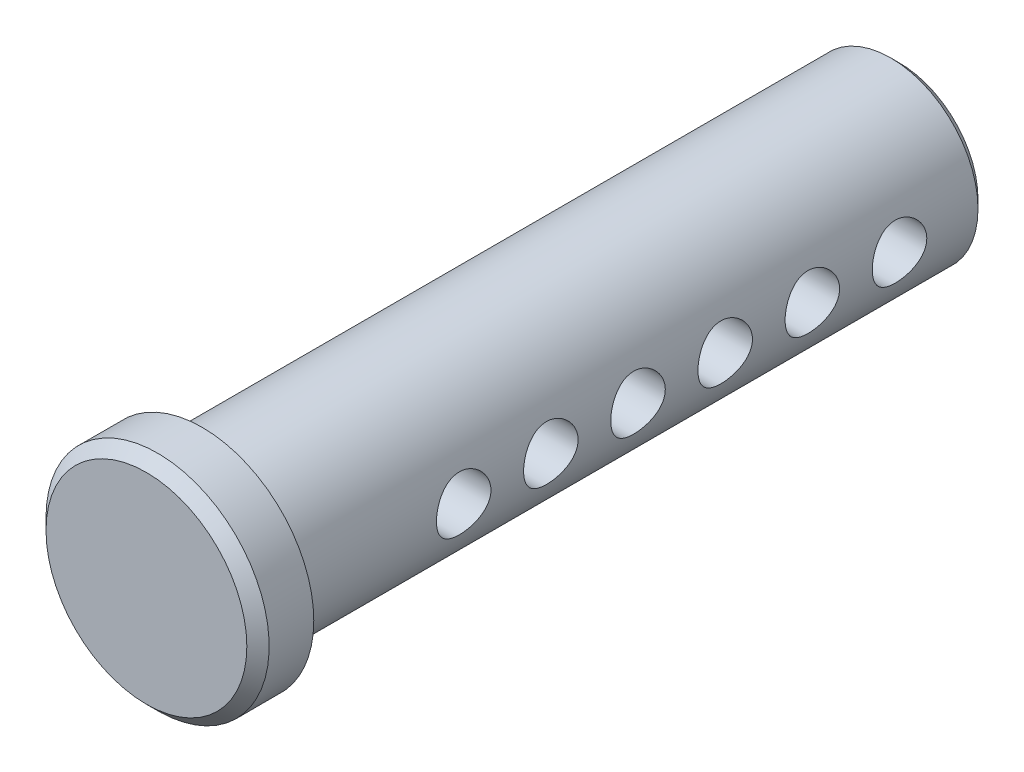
ISO-10303-21;
HEADER;
FILE_DESCRIPTION(('STEP AP214'),'2;1');
FILE_NAME('part.step','',(''),(''),'','','');
FILE_SCHEMA(('AUTOMOTIVE_DESIGN { 1 0 10303 214 1 1 1 1 }'));
ENDSEC;
DATA;
#1=APPLICATION_CONTEXT('core data for automotive mechanical design processes');
#2=APPLICATION_PROTOCOL_DEFINITION('international standard','automotive_design',2000,#1);
#3=PRODUCT_CONTEXT('',#1,'mechanical');
#4=PRODUCT('Part','Part','',(#3));
#5=PRODUCT_RELATED_PRODUCT_CATEGORY('part','',(#4));
#6=PRODUCT_DEFINITION_FORMATION('','',#4);
#7=PRODUCT_DEFINITION_CONTEXT('part definition',#1,'design');
#8=PRODUCT_DEFINITION('design','',#6,#7);
#9=PRODUCT_DEFINITION_SHAPE('','',#8);
#10=(LENGTH_UNIT() NAMED_UNIT(*) SI_UNIT(.MILLI.,.METRE.));
#11=(NAMED_UNIT(*) PLANE_ANGLE_UNIT() SI_UNIT($,.RADIAN.));
#12=(NAMED_UNIT(*) SI_UNIT($,.STERADIAN.) SOLID_ANGLE_UNIT());
#13=UNCERTAINTY_MEASURE_WITH_UNIT(LENGTH_MEASURE(1.E-05),#10,'distance_accuracy_value','');
#14=(GEOMETRIC_REPRESENTATION_CONTEXT(3) GLOBAL_UNCERTAINTY_ASSIGNED_CONTEXT((#13)) GLOBAL_UNIT_ASSIGNED_CONTEXT((#10,
#11,#12)) REPRESENTATION_CONTEXT('',''));
#15=CARTESIAN_POINT('',(0.,0.,0.));
#16=DIRECTION('',(0.,0.,1.));
#17=DIRECTION('',(1.,0.,0.));
#18=AXIS2_PLACEMENT_3D('',#15,#16,#17);
#19=CARTESIAN_POINT('',(0.,0.,25.4));
#20=DIRECTION('',(0.,0.,-1.));
#21=DIRECTION('',(-1.,0.,0.));
#22=AXIS2_PLACEMENT_3D('',#19,#20,#21);
#23=CYLINDRICAL_SURFACE('',#22,6.35);
#24=CARTESIAN_POINT('',(0.,0.,-24.765));
#25=DIRECTION('',(0.,0.,1.));
#26=DIRECTION('',(1.,0.,0.));
#27=AXIS2_PLACEMENT_3D('',#24,#25,#26);
#28=CIRCLE('',#27,6.35);
#29=CARTESIAN_POINT('',(6.35,0.,-24.765));
#30=VERTEX_POINT('',#29);
#31=EDGE_CURVE('E41',#30,#30,#28,.T.);
#32=ORIENTED_EDGE('',*,*,#31,.T.);
#33=EDGE_LOOP('',(#32));
#34=FACE_BOUND('',#33,.T.);
#35=CARTESIAN_POINT('',(-6.35,0.,14.684375));
#36=CARTESIAN_POINT('',(-6.34999945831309,-0.108647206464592,14.6843742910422));
#37=CARTESIAN_POINT('',(-6.34718528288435,-0.217301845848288,14.6754227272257));
#38=CARTESIAN_POINT('',(-6.3362346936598,-0.431433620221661,14.6399468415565));
#39=CARTESIAN_POINT('',(-6.32809707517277,-0.536910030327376,14.6134185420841));
#40=CARTESIAN_POINT('',(-6.30738857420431,-0.741566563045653,14.5437711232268));
#41=CARTESIAN_POINT('',(-6.29482455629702,-0.840756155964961,14.5006776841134));
#42=CARTESIAN_POINT('',(-6.26656051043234,-1.030501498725,14.3992325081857));
#43=CARTESIAN_POINT('',(-6.25085998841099,-1.12105588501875,14.3408783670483));
#44=CARTESIAN_POINT('',(-6.21744714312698,-1.29375746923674,14.2086711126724));
#45=CARTESIAN_POINT('',(-6.19969099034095,-1.37560054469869,14.1344318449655));
#46=CARTESIAN_POINT('',(-6.16442198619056,-1.52590084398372,13.9733839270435));
#47=CARTESIAN_POINT('',(-6.14690918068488,-1.59435557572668,13.8865729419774));
#48=CARTESIAN_POINT('',(-6.11363942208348,-1.71758509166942,13.7002130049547));
#49=CARTESIAN_POINT('',(-6.09793656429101,-1.77197994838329,13.6004022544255));
#50=CARTESIAN_POINT('',(-6.07072385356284,-1.86308588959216,13.3924796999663));
#51=CARTESIAN_POINT('',(-6.05921289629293,-1.89980163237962,13.2843700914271));
#52=CARTESIAN_POINT('',(-6.04214576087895,-1.95339430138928,13.0663504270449));
#53=CARTESIAN_POINT('',(-6.03642069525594,-1.97083537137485,12.9565926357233));
#54=CARTESIAN_POINT('',(-6.03107212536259,-1.98714606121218,12.7355709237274));
#55=CARTESIAN_POINT('',(-6.03144699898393,-1.98602061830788,12.6243074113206));
#56=CARTESIAN_POINT('',(-6.03810687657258,-1.96567146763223,12.408099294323));
#57=CARTESIAN_POINT('',(-6.04415767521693,-1.94716491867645,12.3030787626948));
#58=CARTESIAN_POINT('',(-6.06110715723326,-1.89374166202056,12.097714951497));
#59=CARTESIAN_POINT('',(-6.07200635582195,-1.85882321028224,11.9973721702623));
#60=CARTESIAN_POINT('',(-6.09760407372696,-1.77306088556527,11.8025037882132));
#61=CARTESIAN_POINT('',(-6.11235576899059,-1.72199181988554,11.7080845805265));
#62=CARTESIAN_POINT('',(-6.14397197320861,-1.60553432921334,11.5289206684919));
#63=CARTESIAN_POINT('',(-6.1608370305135,-1.54014218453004,11.4441784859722));
#64=CARTESIAN_POINT('',(-6.19571925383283,-1.39337566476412,11.2827197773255));
#65=CARTESIAN_POINT('',(-6.21375391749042,-1.31140925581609,11.2065442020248));
#66=CARTESIAN_POINT('',(-6.24826618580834,-1.13564099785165,11.0688883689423));
#67=CARTESIAN_POINT('',(-6.26474367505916,-1.04183827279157,11.0074091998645));
#68=CARTESIAN_POINT('',(-6.29445805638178,-0.844017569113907,10.9005247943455));
#69=CARTESIAN_POINT('',(-6.3076686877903,-0.739925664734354,10.855248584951));
#70=CARTESIAN_POINT('',(-6.3291712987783,-0.525094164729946,10.7830096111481));
#71=CARTESIAN_POINT('',(-6.33746477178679,-0.414356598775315,10.7560412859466));
#72=CARTESIAN_POINT('',(-6.34795830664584,-0.193968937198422,10.7221051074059));
#73=CARTESIAN_POINT('',(-6.35038136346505,-0.0844420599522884,10.7144049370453));
#74=CARTESIAN_POINT('',(-6.34952057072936,0.134350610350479,10.7171588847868));
#75=CARTESIAN_POINT('',(-6.34623755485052,0.243616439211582,10.7276103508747));
#76=CARTESIAN_POINT('',(-6.33448002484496,0.455960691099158,10.7657830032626));
#77=CARTESIAN_POINT('',(-6.32613659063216,0.559125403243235,10.7930684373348));
#78=CARTESIAN_POINT('',(-6.30523442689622,0.759383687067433,10.8636027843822));
#79=CARTESIAN_POINT('',(-6.29267517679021,0.856476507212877,10.9068536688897));
#80=CARTESIAN_POINT('',(-6.26425186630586,1.0444676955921,11.009269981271));
#81=CARTESIAN_POINT('',(-6.24831470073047,1.13515733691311,11.0687976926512));
#82=CARTESIAN_POINT('',(-6.21495788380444,1.30550578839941,11.2016432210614));
#83=CARTESIAN_POINT('',(-6.19753783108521,1.38516159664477,11.2749647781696));
#84=CARTESIAN_POINT('',(-6.16230979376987,1.53445759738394,11.4367609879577));
#85=CARTESIAN_POINT('',(-6.14451378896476,1.60357585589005,11.525720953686));
#86=CARTESIAN_POINT('',(-6.11127091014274,1.72594984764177,11.7143635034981));
#87=CARTESIAN_POINT('',(-6.09582399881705,1.77920583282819,11.8140459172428));
#88=CARTESIAN_POINT('',(-6.06919954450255,1.8680125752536,12.0210979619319));
#89=CARTESIAN_POINT('',(-6.05800551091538,1.90363188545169,12.1284359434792));
#90=CARTESIAN_POINT('',(-6.04124983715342,1.95616344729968,12.3480075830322));
#91=CARTESIAN_POINT('',(-6.03568605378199,1.97308281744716,12.4602393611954));
#92=CARTESIAN_POINT('',(-6.03104414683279,1.98722307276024,12.6809564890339));
#93=CARTESIAN_POINT('',(-6.03168409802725,1.98530018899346,12.7893817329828));
#94=CARTESIAN_POINT('',(-6.03869268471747,1.96387748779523,13.0042834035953));
#95=CARTESIAN_POINT('',(-6.04506105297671,1.94437849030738,13.1107599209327));
#96=CARTESIAN_POINT('',(-6.06261192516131,1.88893021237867,13.3172105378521));
#97=CARTESIAN_POINT('',(-6.07372258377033,1.85322594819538,13.4172570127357));
#98=CARTESIAN_POINT('',(-6.0994878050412,1.76657360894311,13.6100191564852));
#99=CARTESIAN_POINT('',(-6.11414308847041,1.71562243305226,13.7027333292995));
#100=CARTESIAN_POINT('',(-6.14606160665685,1.5975913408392,13.8821254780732));
#101=CARTESIAN_POINT('',(-6.16340443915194,1.5299584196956,13.9684254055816));
#102=CARTESIAN_POINT('',(-6.19837785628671,1.38145678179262,14.1287282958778));
#103=CARTESIAN_POINT('',(-6.21600851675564,1.30058452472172,14.2027279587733));
#104=CARTESIAN_POINT('',(-6.25026169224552,1.12472257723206,14.3387485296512));
#105=CARTESIAN_POINT('',(-6.26683248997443,1.02935813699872,14.4002993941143));
#106=CARTESIAN_POINT('',(-6.29644996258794,0.829118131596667,14.5064145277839));
#107=CARTESIAN_POINT('',(-6.30949802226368,0.724246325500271,14.5509854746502));
#108=CARTESIAN_POINT('',(-6.32969033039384,0.517124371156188,14.6186387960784));
#109=CARTESIAN_POINT('',(-6.3372403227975,0.415401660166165,14.6432188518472));
#110=CARTESIAN_POINT('',(-6.34739491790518,0.209121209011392,14.6760856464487));
#111=CARTESIAN_POINT('',(-6.35000052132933,0.104564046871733,14.6843756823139));
#112=CARTESIAN_POINT('',(-6.35,0.,14.684375));
#113=B_SPLINE_CURVE_WITH_KNOTS('',3,(#35,#36,#37,#38,#39,#40,#41,#42,#43,#44,#45,#46,#47,#48,
#49,#50,#51,#52,#53,#54,#55,#56,#57,#58,#59,#60,#61,#62,#63,#64,#65,#66,#67,#68,#69,#70,#71,#72,
#73,#74,#75,#76,#77,#78,#79,#80,#81,#82,#83,#84,#85,#86,#87,#88,#89,#90,#91,#92,#93,#94,#95,#96,
#97,#98,#99,#100,#101,#102,#103,#104,#105,#106,#107,#108,#109,#110,#111,#112),.UNSPECIFIED.,.T.,
.F.,(4,2,2,2,2,2,2,2,2,2,2,2,2,2,2,2,2,2,2,2,2,2,2,2,2,2,2,2,2,2,2,2,2,2,2,2,2,2,4),(0.,
0.325557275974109,0.651188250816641,0.976316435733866,1.30149587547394,1.63572542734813,
1.9700171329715,2.31257111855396,2.65503479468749,2.98718525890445,3.31924739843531,
3.63818356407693,3.95715362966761,4.28078332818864,4.60449717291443,4.94294711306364,
5.28142211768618,5.62253543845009,5.96354510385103,6.29138265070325,6.61917230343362,
6.93881369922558,7.25849457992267,7.58596915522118,7.91353265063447,8.25407573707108,
8.59461341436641,8.93381683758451,9.27289109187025,9.59663123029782,9.92035626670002,
10.2393418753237,10.5583924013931,10.8899247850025,11.2215459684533,11.5639956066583,
11.9063104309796,12.2196961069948,12.5330183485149),.UNSPECIFIED.);
#114=CARTESIAN_POINT('',(-6.35,0.,14.684375));
#115=VERTEX_POINT('',#114);
#116=EDGE_CURVE('E52',#115,#115,#113,.T.);
#117=ORIENTED_EDGE('',*,*,#116,.T.);
#118=EDGE_LOOP('',(#117));
#119=FACE_BOUND('',#118,.T.);
#120=CARTESIAN_POINT('',(6.35,0.,10.715625));
#121=CARTESIAN_POINT('',(6.34999945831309,-0.108647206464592,10.7156257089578));
#122=CARTESIAN_POINT('',(6.34718528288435,-0.217301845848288,10.7245772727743));
#123=CARTESIAN_POINT('',(6.3362346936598,-0.431433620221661,10.7600531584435));
#124=CARTESIAN_POINT('',(6.32809707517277,-0.536910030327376,10.7865814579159));
#125=CARTESIAN_POINT('',(6.30738857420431,-0.741566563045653,10.8562288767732));
#126=CARTESIAN_POINT('',(6.29482455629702,-0.840756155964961,10.8993223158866));
#127=CARTESIAN_POINT('',(6.26656051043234,-1.030501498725,11.0007674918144));
#128=CARTESIAN_POINT('',(6.25085998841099,-1.12105588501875,11.0591216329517));
#129=CARTESIAN_POINT('',(6.21744714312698,-1.29375746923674,11.1913288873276));
#130=CARTESIAN_POINT('',(6.19969099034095,-1.37560054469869,11.2655681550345));
#131=CARTESIAN_POINT('',(6.16442198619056,-1.52590084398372,11.4266160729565));
#132=CARTESIAN_POINT('',(6.14690918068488,-1.59435557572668,11.5134270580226));
#133=CARTESIAN_POINT('',(6.11363942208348,-1.71758509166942,11.6997869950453));
#134=CARTESIAN_POINT('',(6.09793656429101,-1.77197994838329,11.7995977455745));
#135=CARTESIAN_POINT('',(6.07072385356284,-1.86308588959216,12.0075203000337));
#136=CARTESIAN_POINT('',(6.05921289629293,-1.89980163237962,12.1156299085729));
#137=CARTESIAN_POINT('',(6.04214576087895,-1.95339430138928,12.3336495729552));
#138=CARTESIAN_POINT('',(6.03642069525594,-1.97083537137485,12.4434073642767));
#139=CARTESIAN_POINT('',(6.03107212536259,-1.98714606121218,12.6644290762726));
#140=CARTESIAN_POINT('',(6.03144699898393,-1.98602061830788,12.7756925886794));
#141=CARTESIAN_POINT('',(6.03810687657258,-1.96567146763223,12.991900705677));
#142=CARTESIAN_POINT('',(6.04415767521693,-1.94716491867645,13.0969212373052));
#143=CARTESIAN_POINT('',(6.06110715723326,-1.89374166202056,13.302285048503));
#144=CARTESIAN_POINT('',(6.07200635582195,-1.85882321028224,13.4026278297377));
#145=CARTESIAN_POINT('',(6.09760407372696,-1.77306088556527,13.5974962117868));
#146=CARTESIAN_POINT('',(6.11235576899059,-1.72199181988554,13.6919154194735));
#147=CARTESIAN_POINT('',(6.14397197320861,-1.60553432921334,13.8710793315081));
#148=CARTESIAN_POINT('',(6.1608370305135,-1.54014218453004,13.9558215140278));
#149=CARTESIAN_POINT('',(6.19571925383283,-1.39337566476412,14.1172802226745));
#150=CARTESIAN_POINT('',(6.21375391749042,-1.31140925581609,14.1934557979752));
#151=CARTESIAN_POINT('',(6.24826618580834,-1.13564099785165,14.3311116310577));
#152=CARTESIAN_POINT('',(6.26474367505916,-1.04183827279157,14.3925908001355));
#153=CARTESIAN_POINT('',(6.29445805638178,-0.844017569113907,14.4994752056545));
#154=CARTESIAN_POINT('',(6.3076686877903,-0.739925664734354,14.5447514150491));
#155=CARTESIAN_POINT('',(6.3291712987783,-0.525094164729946,14.6169903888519));
#156=CARTESIAN_POINT('',(6.33746477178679,-0.414356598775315,14.6439587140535));
#157=CARTESIAN_POINT('',(6.34795830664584,-0.193968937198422,14.6778948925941));
#158=CARTESIAN_POINT('',(6.35038136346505,-0.0844420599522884,14.6855950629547));
#159=CARTESIAN_POINT('',(6.34952057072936,0.134350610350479,14.6828411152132));
#160=CARTESIAN_POINT('',(6.34623755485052,0.243616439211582,14.6723896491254));
#161=CARTESIAN_POINT('',(6.33448002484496,0.455960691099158,14.6342169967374));
#162=CARTESIAN_POINT('',(6.32613659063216,0.559125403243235,14.6069315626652));
#163=CARTESIAN_POINT('',(6.30523442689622,0.759383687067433,14.5363972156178));
#164=CARTESIAN_POINT('',(6.29267517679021,0.856476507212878,14.4931463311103));
#165=CARTESIAN_POINT('',(6.26425186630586,1.0444676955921,14.390730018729));
#166=CARTESIAN_POINT('',(6.24831470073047,1.13515733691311,14.3312023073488));
#167=CARTESIAN_POINT('',(6.21495788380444,1.30550578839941,14.1983567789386));
#168=CARTESIAN_POINT('',(6.19753783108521,1.38516159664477,14.1250352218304));
#169=CARTESIAN_POINT('',(6.16230979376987,1.53445759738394,13.9632390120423));
#170=CARTESIAN_POINT('',(6.14451378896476,1.60357585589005,13.874279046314));
#171=CARTESIAN_POINT('',(6.11127091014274,1.72594984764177,13.6856364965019));
#172=CARTESIAN_POINT('',(6.09582399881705,1.77920583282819,13.5859540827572));
#173=CARTESIAN_POINT('',(6.06919954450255,1.8680125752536,13.3789020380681));
#174=CARTESIAN_POINT('',(6.05800551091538,1.90363188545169,13.2715640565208));
#175=CARTESIAN_POINT('',(6.04124983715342,1.95616344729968,13.0519924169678));
#176=CARTESIAN_POINT('',(6.03568605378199,1.97308281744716,12.9397606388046));
#177=CARTESIAN_POINT('',(6.03104414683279,1.98722307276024,12.7190435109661));
#178=CARTESIAN_POINT('',(6.03168409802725,1.98530018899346,12.6106182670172));
#179=CARTESIAN_POINT('',(6.03869268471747,1.96387748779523,12.3957165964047));
#180=CARTESIAN_POINT('',(6.04506105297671,1.94437849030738,12.2892400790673));
#181=CARTESIAN_POINT('',(6.06261192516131,1.88893021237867,12.0827894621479));
#182=CARTESIAN_POINT('',(6.07372258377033,1.85322594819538,11.9827429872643));
#183=CARTESIAN_POINT('',(6.0994878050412,1.76657360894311,11.7899808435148));
#184=CARTESIAN_POINT('',(6.11414308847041,1.71562243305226,11.6972666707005));
#185=CARTESIAN_POINT('',(6.14606160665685,1.5975913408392,11.5178745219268));
#186=CARTESIAN_POINT('',(6.16340443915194,1.5299584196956,11.4315745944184));
#187=CARTESIAN_POINT('',(6.19837785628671,1.38145678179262,11.2712717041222));
#188=CARTESIAN_POINT('',(6.21600851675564,1.30058452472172,11.1972720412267));
#189=CARTESIAN_POINT('',(6.25026169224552,1.12472257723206,11.0612514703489));
#190=CARTESIAN_POINT('',(6.26683248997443,1.02935813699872,10.9997006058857));
#191=CARTESIAN_POINT('',(6.29644996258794,0.829118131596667,10.8935854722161));
#192=CARTESIAN_POINT('',(6.30949802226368,0.724246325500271,10.8490145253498));
#193=CARTESIAN_POINT('',(6.32969033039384,0.517124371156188,10.7813612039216));
#194=CARTESIAN_POINT('',(6.3372403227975,0.415401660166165,10.7567811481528));
#195=CARTESIAN_POINT('',(6.34739491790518,0.209121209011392,10.7239143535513));
#196=CARTESIAN_POINT('',(6.35000052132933,0.104564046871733,10.7156243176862));
#197=CARTESIAN_POINT('',(6.35,0.,10.715625));
#198=B_SPLINE_CURVE_WITH_KNOTS('',3,(#120,#121,#122,#123,#124,#125,#126,#127,#128,#129,#130,
#131,#132,#133,#134,#135,#136,#137,#138,#139,#140,#141,#142,#143,#144,#145,#146,#147,#148,#149,
#150,#151,#152,#153,#154,#155,#156,#157,#158,#159,#160,#161,#162,#163,#164,#165,#166,#167,#168,
#169,#170,#171,#172,#173,#174,#175,#176,#177,#178,#179,#180,#181,#182,#183,#184,#185,#186,#187,
#188,#189,#190,#191,#192,#193,#194,#195,#196,#197),.UNSPECIFIED.,.T.,.F.,(4,2,2,2,2,2,2,2,2,2,2,
2,2,2,2,2,2,2,2,2,2,2,2,2,2,2,2,2,2,2,2,2,2,2,2,2,2,2,4),(0.,0.325557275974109,
0.651188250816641,0.976316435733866,1.30149587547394,1.63572542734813,1.9700171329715,
2.31257111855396,2.65503479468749,2.98718525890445,3.31924739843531,3.63818356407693,
3.95715362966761,4.28078332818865,4.60449717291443,4.94294711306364,5.28142211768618,
5.62253543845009,5.96354510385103,6.29138265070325,6.61917230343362,6.93881369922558,
7.25849457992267,7.58596915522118,7.91353265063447,8.25407573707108,8.59461341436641,
8.93381683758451,9.27289109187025,9.59663123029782,9.92035626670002,10.2393418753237,
10.5583924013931,10.8899247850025,11.2215459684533,11.5639956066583,11.9063104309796,
12.2196961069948,12.5330183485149),.UNSPECIFIED.);
#199=CARTESIAN_POINT('',(6.35,0.,10.715625));
#200=VERTEX_POINT('',#199);
#201=EDGE_CURVE('E60',#200,#200,#198,.T.);
#202=ORIENTED_EDGE('',*,*,#201,.T.);
#203=EDGE_LOOP('',(#202));
#204=FACE_BOUND('',#203,.T.);
#205=CARTESIAN_POINT('',(-6.35,0.,8.334375));
#206=CARTESIAN_POINT('',(-6.34999945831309,-0.108647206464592,8.33437429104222));
#207=CARTESIAN_POINT('',(-6.34718528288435,-0.217301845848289,8.32542272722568));
#208=CARTESIAN_POINT('',(-6.3362346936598,-0.431433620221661,8.28994684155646));
#209=CARTESIAN_POINT('',(-6.32809707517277,-0.536910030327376,8.26341854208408));
#210=CARTESIAN_POINT('',(-6.30738857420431,-0.741566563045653,8.19377112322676));
#211=CARTESIAN_POINT('',(-6.29482455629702,-0.840756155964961,8.15067768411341));
#212=CARTESIAN_POINT('',(-6.26656051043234,-1.030501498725,8.04923250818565));
#213=CARTESIAN_POINT('',(-6.25085998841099,-1.12105588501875,7.99087836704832));
#214=CARTESIAN_POINT('',(-6.21744714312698,-1.29375746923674,7.85867111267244));
#215=CARTESIAN_POINT('',(-6.19969099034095,-1.37560054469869,7.78443184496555));
#216=CARTESIAN_POINT('',(-6.16442198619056,-1.52590084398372,7.62338392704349));
#217=CARTESIAN_POINT('',(-6.14690918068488,-1.59435557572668,7.53657294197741));
#218=CARTESIAN_POINT('',(-6.11363942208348,-1.71758509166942,7.35021300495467));
#219=CARTESIAN_POINT('',(-6.09793656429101,-1.77197994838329,7.25040225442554));
#220=CARTESIAN_POINT('',(-6.07072385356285,-1.86308588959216,7.04247969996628));
#221=CARTESIAN_POINT('',(-6.05921289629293,-1.89980163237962,6.93437009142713));
#222=CARTESIAN_POINT('',(-6.04214576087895,-1.95339430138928,6.71635042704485));
#223=CARTESIAN_POINT('',(-6.03642069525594,-1.97083537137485,6.60659263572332));
#224=CARTESIAN_POINT('',(-6.03107212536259,-1.98714606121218,6.38557092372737));
#225=CARTESIAN_POINT('',(-6.03144699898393,-1.98602061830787,6.27430741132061));
#226=CARTESIAN_POINT('',(-6.03810687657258,-1.96567146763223,6.05809929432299));
#227=CARTESIAN_POINT('',(-6.04415767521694,-1.94716491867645,5.95307876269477));
#228=CARTESIAN_POINT('',(-6.06110715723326,-1.89374166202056,5.74771495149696));
#229=CARTESIAN_POINT('',(-6.07200635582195,-1.85882321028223,5.64737217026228));
#230=CARTESIAN_POINT('',(-6.09760407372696,-1.77306088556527,5.45250378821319));
#231=CARTESIAN_POINT('',(-6.11235576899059,-1.72199181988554,5.35808458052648));
#232=CARTESIAN_POINT('',(-6.14397197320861,-1.60553432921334,5.17892066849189));
#233=CARTESIAN_POINT('',(-6.1608370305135,-1.54014218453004,5.09417848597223));
#234=CARTESIAN_POINT('',(-6.19571925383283,-1.39337566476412,4.93271977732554));
#235=CARTESIAN_POINT('',(-6.21375391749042,-1.31140925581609,4.85654420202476));
#236=CARTESIAN_POINT('',(-6.24826618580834,-1.13564099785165,4.71888836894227));
#237=CARTESIAN_POINT('',(-6.26474367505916,-1.04183827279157,4.65740919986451));
#238=CARTESIAN_POINT('',(-6.29445805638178,-0.844017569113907,4.55052479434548));
#239=CARTESIAN_POINT('',(-6.3076686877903,-0.739925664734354,4.50524858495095));
#240=CARTESIAN_POINT('',(-6.3291712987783,-0.525094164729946,4.43300961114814));
#241=CARTESIAN_POINT('',(-6.33746477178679,-0.414356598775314,4.40604128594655));
#242=CARTESIAN_POINT('',(-6.34795830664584,-0.193968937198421,4.37210510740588));
#243=CARTESIAN_POINT('',(-6.35038136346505,-0.084442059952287,4.36440493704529));
#244=CARTESIAN_POINT('',(-6.34952057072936,0.13435061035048,4.36715888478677));
#245=CARTESIAN_POINT('',(-6.34623755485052,0.243616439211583,4.37761035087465));
#246=CARTESIAN_POINT('',(-6.33448002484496,0.455960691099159,4.41578300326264));
#247=CARTESIAN_POINT('',(-6.32613659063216,0.559125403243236,4.44306843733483));
#248=CARTESIAN_POINT('',(-6.30523442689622,0.759383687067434,4.51360278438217));
#249=CARTESIAN_POINT('',(-6.29267517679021,0.856476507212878,4.55685366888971));
#250=CARTESIAN_POINT('',(-6.26425186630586,1.0444676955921,4.65926998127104));
#251=CARTESIAN_POINT('',(-6.24831470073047,1.13515733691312,4.71879769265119));
#252=CARTESIAN_POINT('',(-6.21495788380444,1.30550578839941,4.85164322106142));
#253=CARTESIAN_POINT('',(-6.19753783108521,1.38516159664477,4.92496477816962));
#254=CARTESIAN_POINT('',(-6.16230979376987,1.53445759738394,5.08676098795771));
#255=CARTESIAN_POINT('',(-6.14451378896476,1.60357585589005,5.17572095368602));
#256=CARTESIAN_POINT('',(-6.11127091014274,1.72594984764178,5.36436350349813));
#257=CARTESIAN_POINT('',(-6.09582399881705,1.77920583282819,5.46404591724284));
#258=CARTESIAN_POINT('',(-6.06919954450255,1.8680125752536,5.67109796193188));
#259=CARTESIAN_POINT('',(-6.05800551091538,1.90363188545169,5.77843594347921));
#260=CARTESIAN_POINT('',(-6.04124983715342,1.95616344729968,5.99800758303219));
#261=CARTESIAN_POINT('',(-6.03568605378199,1.97308281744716,6.11023936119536));
#262=CARTESIAN_POINT('',(-6.03104414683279,1.98722307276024,6.33095648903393));
#263=CARTESIAN_POINT('',(-6.03168409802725,1.98530018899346,6.43938173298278));
#264=CARTESIAN_POINT('',(-6.03869268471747,1.96387748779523,6.65428340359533));
#265=CARTESIAN_POINT('',(-6.04506105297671,1.94437849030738,6.76075992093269));
#266=CARTESIAN_POINT('',(-6.06261192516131,1.88893021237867,6.96721053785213));
#267=CARTESIAN_POINT('',(-6.07372258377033,1.85322594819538,7.06725701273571));
#268=CARTESIAN_POINT('',(-6.0994878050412,1.76657360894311,7.26001915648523));
#269=CARTESIAN_POINT('',(-6.11414308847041,1.71562243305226,7.35273332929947));
#270=CARTESIAN_POINT('',(-6.14606160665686,1.5975913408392,7.5321254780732));
#271=CARTESIAN_POINT('',(-6.16340443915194,1.5299584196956,7.61842540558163));
#272=CARTESIAN_POINT('',(-6.19837785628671,1.38145678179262,7.7787282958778));
#273=CARTESIAN_POINT('',(-6.21600851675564,1.30058452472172,7.8527279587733));
#274=CARTESIAN_POINT('',(-6.25026169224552,1.12472257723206,7.98874852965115));
#275=CARTESIAN_POINT('',(-6.26683248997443,1.02935813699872,8.05029939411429));
#276=CARTESIAN_POINT('',(-6.29644996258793,0.829118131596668,8.15641452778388));
#277=CARTESIAN_POINT('',(-6.30949802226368,0.724246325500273,8.20098547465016));
#278=CARTESIAN_POINT('',(-6.32969033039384,0.51712437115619,8.26863879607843));
#279=CARTESIAN_POINT('',(-6.3372403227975,0.415401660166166,8.29321885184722));
#280=CARTESIAN_POINT('',(-6.34739491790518,0.209121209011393,8.32608564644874));
#281=CARTESIAN_POINT('',(-6.35000052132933,0.104564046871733,8.33437568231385));
#282=CARTESIAN_POINT('',(-6.35,0.,8.334375));
#283=B_SPLINE_CURVE_WITH_KNOTS('',3,(#205,#206,#207,#208,#209,#210,#211,#212,#213,#214,#215,
#216,#217,#218,#219,#220,#221,#222,#223,#224,#225,#226,#227,#228,#229,#230,#231,#232,#233,#234,
#235,#236,#237,#238,#239,#240,#241,#242,#243,#244,#245,#246,#247,#248,#249,#250,#251,#252,#253,
#254,#255,#256,#257,#258,#259,#260,#261,#262,#263,#264,#265,#266,#267,#268,#269,#270,#271,#272,
#273,#274,#275,#276,#277,#278,#279,#280,#281,#282),.UNSPECIFIED.,.T.,.F.,(4,2,2,2,2,2,2,2,2,2,2,
2,2,2,2,2,2,2,2,2,2,2,2,2,2,2,2,2,2,2,2,2,2,2,2,2,2,2,4),(0.,0.325557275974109,
0.651188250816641,0.976316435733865,1.30149587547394,1.63572542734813,1.9700171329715,
2.31257111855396,2.65503479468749,2.98718525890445,3.31924739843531,3.63818356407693,
3.95715362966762,4.28078332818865,4.60449717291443,4.94294711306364,5.28142211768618,
5.62253543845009,5.96354510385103,6.29138265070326,6.61917230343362,6.93881369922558,
7.25849457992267,7.58596915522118,7.91353265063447,8.25407573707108,8.59461341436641,
8.9338168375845,9.27289109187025,9.59663123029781,9.92035626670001,10.2393418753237,
10.5583924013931,10.8899247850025,11.2215459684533,11.5639956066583,11.9063104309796,
12.2196961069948,12.5330183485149),.UNSPECIFIED.);
#284=CARTESIAN_POINT('',(-6.35,0.,8.334375));
#285=VERTEX_POINT('',#284);
#286=EDGE_CURVE('E85',#285,#285,#283,.T.);
#287=ORIENTED_EDGE('',*,*,#286,.T.);
#288=EDGE_LOOP('',(#287));
#289=FACE_BOUND('',#288,.T.);
#290=CARTESIAN_POINT('',(6.35,0.,4.36562500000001));
#291=CARTESIAN_POINT('',(6.34999945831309,-0.108647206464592,4.36562570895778));
#292=CARTESIAN_POINT('',(6.34718528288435,-0.217301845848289,4.37457727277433));
#293=CARTESIAN_POINT('',(6.3362346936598,-0.431433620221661,4.41005315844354));
#294=CARTESIAN_POINT('',(6.32809707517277,-0.536910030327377,4.43658145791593));
#295=CARTESIAN_POINT('',(6.30738857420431,-0.741566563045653,4.50622887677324));
#296=CARTESIAN_POINT('',(6.29482455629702,-0.840756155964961,4.54932231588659));
#297=CARTESIAN_POINT('',(6.26656051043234,-1.030501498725,4.65076749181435));
#298=CARTESIAN_POINT('',(6.25085998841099,-1.12105588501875,4.70912163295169));
#299=CARTESIAN_POINT('',(6.21744714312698,-1.29375746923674,4.84132888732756));
#300=CARTESIAN_POINT('',(6.19969099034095,-1.37560054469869,4.91556815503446));
#301=CARTESIAN_POINT('',(6.16442198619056,-1.52590084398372,5.07661607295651));
#302=CARTESIAN_POINT('',(6.14690918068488,-1.59435557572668,5.1634270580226));
#303=CARTESIAN_POINT('',(6.11363942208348,-1.71758509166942,5.34978699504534));
#304=CARTESIAN_POINT('',(6.09793656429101,-1.77197994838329,5.44959774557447));
#305=CARTESIAN_POINT('',(6.07072385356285,-1.86308588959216,5.65752030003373));
#306=CARTESIAN_POINT('',(6.05921289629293,-1.89980163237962,5.76562990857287));
#307=CARTESIAN_POINT('',(6.04214576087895,-1.95339430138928,5.98364957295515));
#308=CARTESIAN_POINT('',(6.03642069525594,-1.97083537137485,6.09340736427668));
#309=CARTESIAN_POINT('',(6.03107212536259,-1.98714606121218,6.31442907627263));
#310=CARTESIAN_POINT('',(6.03144699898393,-1.98602061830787,6.42569258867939));
#311=CARTESIAN_POINT('',(6.03810687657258,-1.96567146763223,6.64190070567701));
#312=CARTESIAN_POINT('',(6.04415767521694,-1.94716491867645,6.74692123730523));
#313=CARTESIAN_POINT('',(6.06110715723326,-1.89374166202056,6.95228504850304));
#314=CARTESIAN_POINT('',(6.07200635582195,-1.85882321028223,7.05262782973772));
#315=CARTESIAN_POINT('',(6.09760407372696,-1.77306088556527,7.24749621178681));
#316=CARTESIAN_POINT('',(6.11235576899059,-1.72199181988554,7.34191541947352));
#317=CARTESIAN_POINT('',(6.14397197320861,-1.60553432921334,7.52107933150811));
#318=CARTESIAN_POINT('',(6.1608370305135,-1.54014218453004,7.60582151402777));
#319=CARTESIAN_POINT('',(6.19571925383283,-1.39337566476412,7.76728022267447));
#320=CARTESIAN_POINT('',(6.21375391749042,-1.31140925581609,7.84345579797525));
#321=CARTESIAN_POINT('',(6.24826618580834,-1.13564099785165,7.98111163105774));
#322=CARTESIAN_POINT('',(6.26474367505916,-1.04183827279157,8.04259080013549));
#323=CARTESIAN_POINT('',(6.29445805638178,-0.844017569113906,8.14947520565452));
#324=CARTESIAN_POINT('',(6.3076686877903,-0.739925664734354,8.19475141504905));
#325=CARTESIAN_POINT('',(6.3291712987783,-0.525094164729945,8.26699038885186));
#326=CARTESIAN_POINT('',(6.33746477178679,-0.414356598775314,8.29395871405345));
#327=CARTESIAN_POINT('',(6.34795830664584,-0.193968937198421,8.32789489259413));
#328=CARTESIAN_POINT('',(6.35038136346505,-0.0844420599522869,8.33559506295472));
#329=CARTESIAN_POINT('',(6.34952057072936,0.134350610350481,8.33284111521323));
#330=CARTESIAN_POINT('',(6.34623755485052,0.243616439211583,8.32238964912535));
#331=CARTESIAN_POINT('',(6.33448002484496,0.455960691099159,8.28421699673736));
#332=CARTESIAN_POINT('',(6.32613659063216,0.559125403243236,8.25693156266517));
#333=CARTESIAN_POINT('',(6.30523442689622,0.759383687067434,8.18639721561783));
#334=CARTESIAN_POINT('',(6.29267517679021,0.856476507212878,8.14314633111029));
#335=CARTESIAN_POINT('',(6.26425186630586,1.0444676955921,8.04073001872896));
#336=CARTESIAN_POINT('',(6.24831470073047,1.13515733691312,7.98120230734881));
#337=CARTESIAN_POINT('',(6.21495788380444,1.30550578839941,7.84835677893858));
#338=CARTESIAN_POINT('',(6.19753783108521,1.38516159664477,7.77503522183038));
#339=CARTESIAN_POINT('',(6.16230979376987,1.53445759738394,7.61323901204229));
#340=CARTESIAN_POINT('',(6.14451378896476,1.60357585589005,7.52427904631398));
#341=CARTESIAN_POINT('',(6.11127091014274,1.72594984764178,7.33563649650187));
#342=CARTESIAN_POINT('',(6.09582399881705,1.77920583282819,7.23595408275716));
#343=CARTESIAN_POINT('',(6.06919954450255,1.8680125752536,7.02890203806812));
#344=CARTESIAN_POINT('',(6.05800551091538,1.90363188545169,6.92156405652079));
#345=CARTESIAN_POINT('',(6.04124983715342,1.95616344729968,6.70199241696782));
#346=CARTESIAN_POINT('',(6.03568605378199,1.97308281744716,6.58976063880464));
#347=CARTESIAN_POINT('',(6.03104414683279,1.98722307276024,6.36904351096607));
#348=CARTESIAN_POINT('',(6.03168409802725,1.98530018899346,6.26061826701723));
#349=CARTESIAN_POINT('',(6.03869268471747,1.96387748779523,6.04571659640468));
#350=CARTESIAN_POINT('',(6.04506105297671,1.94437849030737,5.93924007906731));
#351=CARTESIAN_POINT('',(6.06261192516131,1.88893021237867,5.73278946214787));
#352=CARTESIAN_POINT('',(6.07372258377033,1.85322594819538,5.63274298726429));
#353=CARTESIAN_POINT('',(6.0994878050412,1.76657360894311,5.43998084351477));
#354=CARTESIAN_POINT('',(6.11414308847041,1.71562243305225,5.34726667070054));
#355=CARTESIAN_POINT('',(6.14606160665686,1.5975913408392,5.1678745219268));
#356=CARTESIAN_POINT('',(6.16340443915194,1.5299584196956,5.08157459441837));
#357=CARTESIAN_POINT('',(6.19837785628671,1.38145678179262,4.92127170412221));
#358=CARTESIAN_POINT('',(6.21600851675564,1.30058452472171,4.8472720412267));
#359=CARTESIAN_POINT('',(6.25026169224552,1.12472257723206,4.71125147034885));
#360=CARTESIAN_POINT('',(6.26683248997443,1.02935813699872,4.64970060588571));
#361=CARTESIAN_POINT('',(6.29644996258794,0.829118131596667,4.54358547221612));
#362=CARTESIAN_POINT('',(6.30949802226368,0.724246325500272,4.49901452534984));
#363=CARTESIAN_POINT('',(6.32969033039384,0.517124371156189,4.43136120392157));
#364=CARTESIAN_POINT('',(6.3372403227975,0.415401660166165,4.40678114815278));
#365=CARTESIAN_POINT('',(6.34739491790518,0.209121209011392,4.37391435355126));
#366=CARTESIAN_POINT('',(6.35000052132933,0.104564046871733,4.36562431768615));
#367=CARTESIAN_POINT('',(6.35,0.,4.36562500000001));
#368=B_SPLINE_CURVE_WITH_KNOTS('',3,(#290,#291,#292,#293,#294,#295,#296,#297,#298,#299,#300,
#301,#302,#303,#304,#305,#306,#307,#308,#309,#310,#311,#312,#313,#314,#315,#316,#317,#318,#319,
#320,#321,#322,#323,#324,#325,#326,#327,#328,#329,#330,#331,#332,#333,#334,#335,#336,#337,#338,
#339,#340,#341,#342,#343,#344,#345,#346,#347,#348,#349,#350,#351,#352,#353,#354,#355,#356,#357,
#358,#359,#360,#361,#362,#363,#364,#365,#366,#367),.UNSPECIFIED.,.T.,.F.,(4,2,2,2,2,2,2,2,2,2,2,
2,2,2,2,2,2,2,2,2,2,2,2,2,2,2,2,2,2,2,2,2,2,2,2,2,2,2,4),(0.,0.325557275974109,
0.651188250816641,0.976316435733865,1.30149587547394,1.63572542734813,1.9700171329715,
2.31257111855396,2.65503479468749,2.98718525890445,3.31924739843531,3.63818356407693,
3.95715362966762,4.28078332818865,4.60449717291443,4.94294711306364,5.28142211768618,
5.62253543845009,5.96354510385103,6.29138265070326,6.61917230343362,6.93881369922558,
7.25849457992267,7.58596915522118,7.91353265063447,8.25407573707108,8.59461341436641,
8.9338168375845,9.27289109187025,9.59663123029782,9.92035626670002,10.2393418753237,
10.5583924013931,10.8899247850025,11.2215459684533,11.5639956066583,11.9063104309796,
12.2196961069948,12.5330183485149),.UNSPECIFIED.);
#369=CARTESIAN_POINT('',(6.35,0.,4.36562500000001));
#370=VERTEX_POINT('',#369);
#371=EDGE_CURVE('E59',#370,#370,#368,.T.);
#372=ORIENTED_EDGE('',*,*,#371,.T.);
#373=EDGE_LOOP('',(#372));
#374=FACE_BOUND('',#373,.T.);
#375=CARTESIAN_POINT('',(-6.35,0.,1.984375));
#376=CARTESIAN_POINT('',(-6.34999945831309,-0.108647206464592,1.98437429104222));
#377=CARTESIAN_POINT('',(-6.34718528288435,-0.217301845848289,1.97542272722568));
#378=CARTESIAN_POINT('',(-6.3362346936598,-0.431433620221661,1.93994684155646));
#379=CARTESIAN_POINT('',(-6.32809707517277,-0.536910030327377,1.91341854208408));
#380=CARTESIAN_POINT('',(-6.30738857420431,-0.741566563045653,1.84377112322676));
#381=CARTESIAN_POINT('',(-6.29482455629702,-0.840756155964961,1.80067768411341));
#382=CARTESIAN_POINT('',(-6.26656051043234,-1.030501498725,1.69923250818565));
#383=CARTESIAN_POINT('',(-6.25085998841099,-1.12105588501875,1.64087836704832));
#384=CARTESIAN_POINT('',(-6.21744714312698,-1.29375746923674,1.50867111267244));
#385=CARTESIAN_POINT('',(-6.19969099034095,-1.37560054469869,1.43443184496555));
#386=CARTESIAN_POINT('',(-6.16442198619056,-1.52590084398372,1.27338392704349));
#387=CARTESIAN_POINT('',(-6.14690918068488,-1.59435557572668,1.1865729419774));
#388=CARTESIAN_POINT('',(-6.11363942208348,-1.71758509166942,1.00021300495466));
#389=CARTESIAN_POINT('',(-6.09793656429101,-1.77197994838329,0.900402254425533));
#390=CARTESIAN_POINT('',(-6.07072385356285,-1.86308588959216,0.692479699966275));
#391=CARTESIAN_POINT('',(-6.05921289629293,-1.89980163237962,0.584370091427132));
#392=CARTESIAN_POINT('',(-6.04214576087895,-1.95339430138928,0.366350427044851));
#393=CARTESIAN_POINT('',(-6.03642069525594,-1.97083537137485,0.25659263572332));
#394=CARTESIAN_POINT('',(-6.03107212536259,-1.98714606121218,0.0355709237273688));
#395=CARTESIAN_POINT('',(-6.03144699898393,-1.98602061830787,-0.0756925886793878));
#396=CARTESIAN_POINT('',(-6.03810687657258,-1.96567146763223,-0.291900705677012));
#397=CARTESIAN_POINT('',(-6.04415767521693,-1.94716491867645,-0.396921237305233));
#398=CARTESIAN_POINT('',(-6.06110715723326,-1.89374166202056,-0.602285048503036));
#399=CARTESIAN_POINT('',(-6.07200635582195,-1.85882321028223,-0.702627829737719));
#400=CARTESIAN_POINT('',(-6.09760407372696,-1.77306088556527,-0.897496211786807));
#401=CARTESIAN_POINT('',(-6.11235576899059,-1.72199181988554,-0.991915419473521));
#402=CARTESIAN_POINT('',(-6.14397197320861,-1.60553432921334,-1.17107933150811));
#403=CARTESIAN_POINT('',(-6.1608370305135,-1.54014218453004,-1.25582151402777));
#404=CARTESIAN_POINT('',(-6.19571925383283,-1.39337566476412,-1.41728022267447));
#405=CARTESIAN_POINT('',(-6.21375391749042,-1.31140925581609,-1.49345579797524));
#406=CARTESIAN_POINT('',(-6.24826618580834,-1.13564099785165,-1.63111163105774));
#407=CARTESIAN_POINT('',(-6.26474367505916,-1.04183827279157,-1.69259080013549));
#408=CARTESIAN_POINT('',(-6.29445805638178,-0.844017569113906,-1.79947520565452));
#409=CARTESIAN_POINT('',(-6.3076686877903,-0.739925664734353,-1.84475141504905));
#410=CARTESIAN_POINT('',(-6.3291712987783,-0.525094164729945,-1.91699038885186));
#411=CARTESIAN_POINT('',(-6.33746477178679,-0.414356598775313,-1.94395871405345));
#412=CARTESIAN_POINT('',(-6.34795830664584,-0.193968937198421,-1.97789489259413));
#413=CARTESIAN_POINT('',(-6.35038136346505,-0.084442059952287,-1.98559506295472));
#414=CARTESIAN_POINT('',(-6.34952057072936,0.134350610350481,-1.98284111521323));
#415=CARTESIAN_POINT('',(-6.34623755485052,0.243616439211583,-1.97238964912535));
#416=CARTESIAN_POINT('',(-6.33448002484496,0.45596069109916,-1.93421699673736));
#417=CARTESIAN_POINT('',(-6.32613659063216,0.559125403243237,-1.90693156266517));
#418=CARTESIAN_POINT('',(-6.30523442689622,0.759383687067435,-1.83639721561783));
#419=CARTESIAN_POINT('',(-6.29267517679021,0.856476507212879,-1.79314633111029));
#420=CARTESIAN_POINT('',(-6.26425186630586,1.0444676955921,-1.69073001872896));
#421=CARTESIAN_POINT('',(-6.24831470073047,1.13515733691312,-1.63120230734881));
#422=CARTESIAN_POINT('',(-6.21495788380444,1.30550578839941,-1.49835677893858));
#423=CARTESIAN_POINT('',(-6.19753783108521,1.38516159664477,-1.42503522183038));
#424=CARTESIAN_POINT('',(-6.16230979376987,1.53445759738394,-1.26323901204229));
#425=CARTESIAN_POINT('',(-6.14451378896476,1.60357585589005,-1.17427904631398));
#426=CARTESIAN_POINT('',(-6.11127091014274,1.72594984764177,-0.985636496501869));
#427=CARTESIAN_POINT('',(-6.09582399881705,1.77920583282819,-0.885954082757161));
#428=CARTESIAN_POINT('',(-6.06919954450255,1.8680125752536,-0.678902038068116));
#429=CARTESIAN_POINT('',(-6.05800551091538,1.90363188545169,-0.571564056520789));
#430=CARTESIAN_POINT('',(-6.04124983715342,1.95616344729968,-0.351992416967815));
#431=CARTESIAN_POINT('',(-6.03568605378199,1.97308281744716,-0.239760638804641));
#432=CARTESIAN_POINT('',(-6.03104414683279,1.98722307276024,-0.0190435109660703));
#433=CARTESIAN_POINT('',(-6.03168409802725,1.98530018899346,0.0893817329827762));
#434=CARTESIAN_POINT('',(-6.03869268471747,1.96387748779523,0.304283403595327));
#435=CARTESIAN_POINT('',(-6.04506105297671,1.94437849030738,0.410759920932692));
#436=CARTESIAN_POINT('',(-6.06261192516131,1.88893021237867,0.617210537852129));
#437=CARTESIAN_POINT('',(-6.07372258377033,1.85322594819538,0.71725701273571));
#438=CARTESIAN_POINT('',(-6.0994878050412,1.76657360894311,0.910019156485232));
#439=CARTESIAN_POINT('',(-6.11414308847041,1.71562243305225,1.00273332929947));
#440=CARTESIAN_POINT('',(-6.14606160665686,1.5975913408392,1.1821254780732));
#441=CARTESIAN_POINT('',(-6.16340443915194,1.5299584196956,1.26842540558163));
#442=CARTESIAN_POINT('',(-6.19837785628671,1.38145678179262,1.42872829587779));
#443=CARTESIAN_POINT('',(-6.21600851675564,1.30058452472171,1.5027279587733));
#444=CARTESIAN_POINT('',(-6.25026169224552,1.12472257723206,1.63874852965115));
#445=CARTESIAN_POINT('',(-6.26683248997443,1.02935813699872,1.70029939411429));
#446=CARTESIAN_POINT('',(-6.29644996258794,0.829118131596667,1.80641452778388));
#447=CARTESIAN_POINT('',(-6.30949802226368,0.724246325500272,1.85098547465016));
#448=CARTESIAN_POINT('',(-6.32969033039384,0.517124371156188,1.91863879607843));
#449=CARTESIAN_POINT('',(-6.3372403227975,0.415401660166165,1.94321885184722));
#450=CARTESIAN_POINT('',(-6.34739491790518,0.209121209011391,1.97608564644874));
#451=CARTESIAN_POINT('',(-6.35000052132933,0.104564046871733,1.98437568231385));
#452=CARTESIAN_POINT('',(-6.35,0.,1.984375));
#453=B_SPLINE_CURVE_WITH_KNOTS('',3,(#375,#376,#377,#378,#379,#380,#381,#382,#383,#384,#385,
#386,#387,#388,#389,#390,#391,#392,#393,#394,#395,#396,#397,#398,#399,#400,#401,#402,#403,#404,
#405,#406,#407,#408,#409,#410,#411,#412,#413,#414,#415,#416,#417,#418,#419,#420,#421,#422,#423,
#424,#425,#426,#427,#428,#429,#430,#431,#432,#433,#434,#435,#436,#437,#438,#439,#440,#441,#442,
#443,#444,#445,#446,#447,#448,#449,#450,#451,#452),.UNSPECIFIED.,.T.,.F.,(4,2,2,2,2,2,2,2,2,2,2,
2,2,2,2,2,2,2,2,2,2,2,2,2,2,2,2,2,2,2,2,2,2,2,2,2,2,2,4),(0.,0.325557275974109,
0.651188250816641,0.976316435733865,1.30149587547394,1.63572542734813,1.97001713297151,
2.31257111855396,2.65503479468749,2.98718525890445,3.31924739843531,3.63818356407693,
3.95715362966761,4.28078332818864,4.60449717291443,4.94294711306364,5.28142211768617,
5.62253543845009,5.96354510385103,6.29138265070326,6.61917230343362,6.93881369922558,
7.25849457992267,7.58596915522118,7.91353265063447,8.25407573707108,8.59461341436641,
8.9338168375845,9.27289109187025,9.59663123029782,9.92035626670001,10.2393418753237,
10.5583924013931,10.8899247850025,11.2215459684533,11.5639956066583,11.9063104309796,
12.2196961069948,12.5330183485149),.UNSPECIFIED.);
#454=CARTESIAN_POINT('',(-6.35,0.,1.984375));
#455=VERTEX_POINT('',#454);
#456=EDGE_CURVE('E93',#455,#455,#453,.T.);
#457=ORIENTED_EDGE('',*,*,#456,.T.);
#458=EDGE_LOOP('',(#457));
#459=FACE_BOUND('',#458,.T.);
#460=CARTESIAN_POINT('',(6.35,0.,-1.984375));
#461=CARTESIAN_POINT('',(6.34999945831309,-0.108647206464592,-1.98437429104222));
#462=CARTESIAN_POINT('',(6.34718528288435,-0.217301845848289,-1.97542272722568));
#463=CARTESIAN_POINT('',(6.3362346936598,-0.431433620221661,-1.93994684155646));
#464=CARTESIAN_POINT('',(6.32809707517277,-0.536910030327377,-1.91341854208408));
#465=CARTESIAN_POINT('',(6.30738857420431,-0.741566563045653,-1.84377112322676));
#466=CARTESIAN_POINT('',(6.29482455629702,-0.840756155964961,-1.80067768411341));
#467=CARTESIAN_POINT('',(6.26656051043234,-1.030501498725,-1.69923250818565));
#468=CARTESIAN_POINT('',(6.25085998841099,-1.12105588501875,-1.64087836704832));
#469=CARTESIAN_POINT('',(6.21744714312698,-1.29375746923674,-1.50867111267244));
#470=CARTESIAN_POINT('',(6.19969099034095,-1.37560054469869,-1.43443184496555));
#471=CARTESIAN_POINT('',(6.16442198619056,-1.52590084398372,-1.27338392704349));
#472=CARTESIAN_POINT('',(6.14690918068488,-1.59435557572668,-1.1865729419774));
#473=CARTESIAN_POINT('',(6.11363942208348,-1.71758509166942,-1.00021300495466));
#474=CARTESIAN_POINT('',(6.09793656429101,-1.77197994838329,-0.900402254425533));
#475=CARTESIAN_POINT('',(6.07072385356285,-1.86308588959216,-0.692479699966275));
#476=CARTESIAN_POINT('',(6.05921289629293,-1.89980163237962,-0.584370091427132));
#477=CARTESIAN_POINT('',(6.04214576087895,-1.95339430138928,-0.366350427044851));
#478=CARTESIAN_POINT('',(6.03642069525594,-1.97083537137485,-0.25659263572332));
#479=CARTESIAN_POINT('',(6.03107212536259,-1.98714606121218,-0.0355709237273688));
#480=CARTESIAN_POINT('',(6.03144699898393,-1.98602061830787,0.0756925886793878));
#481=CARTESIAN_POINT('',(6.03810687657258,-1.96567146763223,0.291900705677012));
#482=CARTESIAN_POINT('',(6.04415767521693,-1.94716491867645,0.396921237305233));
#483=CARTESIAN_POINT('',(6.06110715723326,-1.89374166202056,0.602285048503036));
#484=CARTESIAN_POINT('',(6.07200635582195,-1.85882321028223,0.702627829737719));
#485=CARTESIAN_POINT('',(6.09760407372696,-1.77306088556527,0.897496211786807));
#486=CARTESIAN_POINT('',(6.11235576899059,-1.72199181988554,0.991915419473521));
#487=CARTESIAN_POINT('',(6.14397197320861,-1.60553432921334,1.17107933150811));
#488=CARTESIAN_POINT('',(6.1608370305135,-1.54014218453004,1.25582151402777));
#489=CARTESIAN_POINT('',(6.19571925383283,-1.39337566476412,1.41728022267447));
#490=CARTESIAN_POINT('',(6.21375391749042,-1.31140925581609,1.49345579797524));
#491=CARTESIAN_POINT('',(6.24826618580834,-1.13564099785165,1.63111163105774));
#492=CARTESIAN_POINT('',(6.26474367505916,-1.04183827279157,1.69259080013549));
#493=CARTESIAN_POINT('',(6.29445805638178,-0.844017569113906,1.79947520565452));
#494=CARTESIAN_POINT('',(6.3076686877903,-0.739925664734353,1.84475141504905));
#495=CARTESIAN_POINT('',(6.3291712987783,-0.525094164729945,1.91699038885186));
#496=CARTESIAN_POINT('',(6.33746477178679,-0.414356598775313,1.94395871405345));
#497=CARTESIAN_POINT('',(6.34795830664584,-0.193968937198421,1.97789489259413));
#498=CARTESIAN_POINT('',(6.35038136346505,-0.084442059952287,1.98559506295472));
#499=CARTESIAN_POINT('',(6.34952057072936,0.134350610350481,1.98284111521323));
#500=CARTESIAN_POINT('',(6.34623755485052,0.243616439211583,1.97238964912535));
#501=CARTESIAN_POINT('',(6.33448002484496,0.45596069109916,1.93421699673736));
#502=CARTESIAN_POINT('',(6.32613659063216,0.559125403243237,1.90693156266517));
#503=CARTESIAN_POINT('',(6.30523442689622,0.759383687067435,1.83639721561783));
#504=CARTESIAN_POINT('',(6.29267517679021,0.856476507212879,1.79314633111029));
#505=CARTESIAN_POINT('',(6.26425186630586,1.0444676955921,1.69073001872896));
#506=CARTESIAN_POINT('',(6.24831470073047,1.13515733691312,1.63120230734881));
#507=CARTESIAN_POINT('',(6.21495788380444,1.30550578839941,1.49835677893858));
#508=CARTESIAN_POINT('',(6.19753783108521,1.38516159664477,1.42503522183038));
#509=CARTESIAN_POINT('',(6.16230979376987,1.53445759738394,1.26323901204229));
#510=CARTESIAN_POINT('',(6.14451378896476,1.60357585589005,1.17427904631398));
#511=CARTESIAN_POINT('',(6.11127091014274,1.72594984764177,0.985636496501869));
#512=CARTESIAN_POINT('',(6.09582399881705,1.77920583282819,0.885954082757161));
#513=CARTESIAN_POINT('',(6.06919954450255,1.8680125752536,0.678902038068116));
#514=CARTESIAN_POINT('',(6.05800551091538,1.90363188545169,0.571564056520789));
#515=CARTESIAN_POINT('',(6.04124983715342,1.95616344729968,0.351992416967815));
#516=CARTESIAN_POINT('',(6.03568605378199,1.97308281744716,0.239760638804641));
#517=CARTESIAN_POINT('',(6.03104414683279,1.98722307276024,0.0190435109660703));
#518=CARTESIAN_POINT('',(6.03168409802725,1.98530018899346,-0.0893817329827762));
#519=CARTESIAN_POINT('',(6.03869268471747,1.96387748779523,-0.304283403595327));
#520=CARTESIAN_POINT('',(6.04506105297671,1.94437849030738,-0.410759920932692));
#521=CARTESIAN_POINT('',(6.06261192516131,1.88893021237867,-0.617210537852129));
#522=CARTESIAN_POINT('',(6.07372258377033,1.85322594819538,-0.71725701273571));
#523=CARTESIAN_POINT('',(6.0994878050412,1.76657360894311,-0.910019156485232));
#524=CARTESIAN_POINT('',(6.11414308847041,1.71562243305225,-1.00273332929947));
#525=CARTESIAN_POINT('',(6.14606160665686,1.5975913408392,-1.1821254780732));
#526=CARTESIAN_POINT('',(6.16340443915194,1.5299584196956,-1.26842540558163));
#527=CARTESIAN_POINT('',(6.19837785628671,1.38145678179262,-1.42872829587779));
#528=CARTESIAN_POINT('',(6.21600851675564,1.30058452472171,-1.5027279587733));
#529=CARTESIAN_POINT('',(6.25026169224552,1.12472257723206,-1.63874852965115));
#530=CARTESIAN_POINT('',(6.26683248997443,1.02935813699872,-1.70029939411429));
#531=CARTESIAN_POINT('',(6.29644996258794,0.829118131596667,-1.80641452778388));
#532=CARTESIAN_POINT('',(6.30949802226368,0.724246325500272,-1.85098547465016));
#533=CARTESIAN_POINT('',(6.32969033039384,0.517124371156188,-1.91863879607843));
#534=CARTESIAN_POINT('',(6.3372403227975,0.415401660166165,-1.94321885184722));
#535=CARTESIAN_POINT('',(6.34739491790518,0.209121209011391,-1.97608564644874));
#536=CARTESIAN_POINT('',(6.35000052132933,0.104564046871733,-1.98437568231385));
#537=CARTESIAN_POINT('',(6.35,0.,-1.984375));
#538=B_SPLINE_CURVE_WITH_KNOTS('',3,(#460,#461,#462,#463,#464,#465,#466,#467,#468,#469,#470,
#471,#472,#473,#474,#475,#476,#477,#478,#479,#480,#481,#482,#483,#484,#485,#486,#487,#488,#489,
#490,#491,#492,#493,#494,#495,#496,#497,#498,#499,#500,#501,#502,#503,#504,#505,#506,#507,#508,
#509,#510,#511,#512,#513,#514,#515,#516,#517,#518,#519,#520,#521,#522,#523,#524,#525,#526,#527,
#528,#529,#530,#531,#532,#533,#534,#535,#536,#537),.UNSPECIFIED.,.T.,.F.,(4,2,2,2,2,2,2,2,2,2,2,
2,2,2,2,2,2,2,2,2,2,2,2,2,2,2,2,2,2,2,2,2,2,2,2,2,2,2,4),(0.,0.325557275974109,
0.651188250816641,0.976316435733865,1.30149587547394,1.63572542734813,1.97001713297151,
2.31257111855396,2.65503479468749,2.98718525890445,3.31924739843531,3.63818356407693,
3.95715362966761,4.28078332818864,4.60449717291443,4.94294711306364,5.28142211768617,
5.62253543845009,5.96354510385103,6.29138265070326,6.61917230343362,6.93881369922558,
7.25849457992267,7.58596915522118,7.91353265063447,8.25407573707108,8.59461341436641,
8.9338168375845,9.27289109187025,9.59663123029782,9.92035626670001,10.2393418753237,
10.5583924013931,10.8899247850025,11.2215459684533,11.5639956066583,11.9063104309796,
12.2196961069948,12.5330183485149),.UNSPECIFIED.);
#539=CARTESIAN_POINT('',(6.35,0.,-1.984375));
#540=VERTEX_POINT('',#539);
#541=EDGE_CURVE('E89',#540,#540,#538,.T.);
#542=ORIENTED_EDGE('',*,*,#541,.T.);
#543=EDGE_LOOP('',(#542));
#544=FACE_BOUND('',#543,.T.);
#545=CARTESIAN_POINT('',(-6.35,0.,-4.36562500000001));
#546=CARTESIAN_POINT('',(-6.34999945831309,-0.108647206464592,-4.36562570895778));
#547=CARTESIAN_POINT('',(-6.34718528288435,-0.217301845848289,-4.37457727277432));
#548=CARTESIAN_POINT('',(-6.3362346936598,-0.431433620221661,-4.41005315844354));
#549=CARTESIAN_POINT('',(-6.32809707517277,-0.536910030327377,-4.43658145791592));
#550=CARTESIAN_POINT('',(-6.30738857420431,-0.741566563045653,-4.50622887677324));
#551=CARTESIAN_POINT('',(-6.29482455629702,-0.840756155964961,-4.54932231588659));
#552=CARTESIAN_POINT('',(-6.26656051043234,-1.030501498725,-4.65076749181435));
#553=CARTESIAN_POINT('',(-6.25085998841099,-1.12105588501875,-4.70912163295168));
#554=CARTESIAN_POINT('',(-6.21744714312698,-1.29375746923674,-4.84132888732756));
#555=CARTESIAN_POINT('',(-6.19969099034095,-1.37560054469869,-4.91556815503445));
#556=CARTESIAN_POINT('',(-6.16442198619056,-1.52590084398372,-5.07661607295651));
#557=CARTESIAN_POINT('',(-6.14690918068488,-1.59435557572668,-5.16342705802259));
#558=CARTESIAN_POINT('',(-6.11363942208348,-1.71758509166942,-5.34978699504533));
#559=CARTESIAN_POINT('',(-6.09793656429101,-1.77197994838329,-5.44959774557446));
#560=CARTESIAN_POINT('',(-6.07072385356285,-1.86308588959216,-5.65752030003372));
#561=CARTESIAN_POINT('',(-6.05921289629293,-1.89980163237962,-5.76562990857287));
#562=CARTESIAN_POINT('',(-6.04214576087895,-1.95339430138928,-5.98364957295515));
#563=CARTESIAN_POINT('',(-6.03642069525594,-1.97083537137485,-6.09340736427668));
#564=CARTESIAN_POINT('',(-6.03107212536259,-1.98714606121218,-6.31442907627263));
#565=CARTESIAN_POINT('',(-6.03144699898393,-1.98602061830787,-6.42569258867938));
#566=CARTESIAN_POINT('',(-6.03810687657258,-1.96567146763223,-6.64190070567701));
#567=CARTESIAN_POINT('',(-6.04415767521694,-1.94716491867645,-6.74692123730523));
#568=CARTESIAN_POINT('',(-6.06110715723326,-1.89374166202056,-6.95228504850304));
#569=CARTESIAN_POINT('',(-6.07200635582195,-1.85882321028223,-7.05262782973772));
#570=CARTESIAN_POINT('',(-6.09760407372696,-1.77306088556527,-7.24749621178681));
#571=CARTESIAN_POINT('',(-6.11235576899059,-1.72199181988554,-7.34191541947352));
#572=CARTESIAN_POINT('',(-6.14397197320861,-1.60553432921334,-7.52107933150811));
#573=CARTESIAN_POINT('',(-6.1608370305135,-1.54014218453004,-7.60582151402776));
#574=CARTESIAN_POINT('',(-6.19571925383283,-1.39337566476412,-7.76728022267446));
#575=CARTESIAN_POINT('',(-6.21375391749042,-1.31140925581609,-7.84345579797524));
#576=CARTESIAN_POINT('',(-6.24826618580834,-1.13564099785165,-7.98111163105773));
#577=CARTESIAN_POINT('',(-6.26474367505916,-1.04183827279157,-8.04259080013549));
#578=CARTESIAN_POINT('',(-6.29445805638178,-0.844017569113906,-8.14947520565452));
#579=CARTESIAN_POINT('',(-6.3076686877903,-0.739925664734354,-8.19475141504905));
#580=CARTESIAN_POINT('',(-6.32917129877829,-0.525094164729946,-8.26699038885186));
#581=CARTESIAN_POINT('',(-6.33746477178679,-0.414356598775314,-8.29395871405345));
#582=CARTESIAN_POINT('',(-6.34795830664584,-0.193968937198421,-8.32789489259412));
#583=CARTESIAN_POINT('',(-6.35038136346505,-0.0844420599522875,-8.33559506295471));
#584=CARTESIAN_POINT('',(-6.34952057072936,0.13435061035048,-8.33284111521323));
#585=CARTESIAN_POINT('',(-6.34623755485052,0.243616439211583,-8.32238964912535));
#586=CARTESIAN_POINT('',(-6.33448002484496,0.455960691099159,-8.28421699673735));
#587=CARTESIAN_POINT('',(-6.32613659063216,0.559125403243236,-8.25693156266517));
#588=CARTESIAN_POINT('',(-6.30523442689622,0.759383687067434,-8.18639721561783));
#589=CARTESIAN_POINT('',(-6.29267517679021,0.856476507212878,-8.14314633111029));
#590=CARTESIAN_POINT('',(-6.26425186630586,1.0444676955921,-8.04073001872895));
#591=CARTESIAN_POINT('',(-6.24831470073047,1.13515733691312,-7.98120230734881));
#592=CARTESIAN_POINT('',(-6.21495788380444,1.30550578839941,-7.84835677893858));
#593=CARTESIAN_POINT('',(-6.19753783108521,1.38516159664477,-7.77503522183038));
#594=CARTESIAN_POINT('',(-6.16230979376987,1.53445759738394,-7.61323901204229));
#595=CARTESIAN_POINT('',(-6.14451378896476,1.60357585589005,-7.52427904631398));
#596=CARTESIAN_POINT('',(-6.11127091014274,1.72594984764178,-7.33563649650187));
#597=CARTESIAN_POINT('',(-6.09582399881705,1.77920583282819,-7.23595408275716));
#598=CARTESIAN_POINT('',(-6.06919954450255,1.8680125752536,-7.02890203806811));
#599=CARTESIAN_POINT('',(-6.05800551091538,1.90363188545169,-6.92156405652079));
#600=CARTESIAN_POINT('',(-6.04124983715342,1.95616344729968,-6.70199241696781));
#601=CARTESIAN_POINT('',(-6.03568605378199,1.97308281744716,-6.58976063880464));
#602=CARTESIAN_POINT('',(-6.03104414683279,1.98722307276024,-6.36904351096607));
#603=CARTESIAN_POINT('',(-6.03168409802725,1.98530018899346,-6.26061826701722));
#604=CARTESIAN_POINT('',(-6.03869268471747,1.96387748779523,-6.04571659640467));
#605=CARTESIAN_POINT('',(-6.04506105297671,1.94437849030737,-5.93924007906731));
#606=CARTESIAN_POINT('',(-6.06261192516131,1.88893021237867,-5.73278946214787));
#607=CARTESIAN_POINT('',(-6.07372258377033,1.85322594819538,-5.63274298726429));
#608=CARTESIAN_POINT('',(-6.0994878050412,1.76657360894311,-5.43998084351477));
#609=CARTESIAN_POINT('',(-6.11414308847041,1.71562243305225,-5.34726667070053));
#610=CARTESIAN_POINT('',(-6.14606160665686,1.5975913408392,-5.1678745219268));
#611=CARTESIAN_POINT('',(-6.16340443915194,1.5299584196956,-5.08157459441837));
#612=CARTESIAN_POINT('',(-6.19837785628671,1.38145678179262,-4.9212717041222));
#613=CARTESIAN_POINT('',(-6.21600851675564,1.30058452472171,-4.84727204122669));
#614=CARTESIAN_POINT('',(-6.25026169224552,1.12472257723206,-4.71125147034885));
#615=CARTESIAN_POINT('',(-6.26683248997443,1.02935813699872,-4.6497006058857));
#616=CARTESIAN_POINT('',(-6.29644996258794,0.829118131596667,-4.54358547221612));
#617=CARTESIAN_POINT('',(-6.30949802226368,0.724246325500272,-4.49901452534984));
#618=CARTESIAN_POINT('',(-6.32969033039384,0.517124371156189,-4.43136120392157));
#619=CARTESIAN_POINT('',(-6.3372403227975,0.415401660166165,-4.40678114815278));
#620=CARTESIAN_POINT('',(-6.34739491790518,0.209121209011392,-4.37391435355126));
#621=CARTESIAN_POINT('',(-6.35000052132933,0.104564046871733,-4.36562431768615));
#622=CARTESIAN_POINT('',(-6.35,0.,-4.36562500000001));
#623=B_SPLINE_CURVE_WITH_KNOTS('',3,(#545,#546,#547,#548,#549,#550,#551,#552,#553,#554,#555,
#556,#557,#558,#559,#560,#561,#562,#563,#564,#565,#566,#567,#568,#569,#570,#571,#572,#573,#574,
#575,#576,#577,#578,#579,#580,#581,#582,#583,#584,#585,#586,#587,#588,#589,#590,#591,#592,#593,
#594,#595,#596,#597,#598,#599,#600,#601,#602,#603,#604,#605,#606,#607,#608,#609,#610,#611,#612,
#613,#614,#615,#616,#617,#618,#619,#620,#621,#622),.UNSPECIFIED.,.T.,.F.,(4,2,2,2,2,2,2,2,2,2,2,
2,2,2,2,2,2,2,2,2,2,2,2,2,2,2,2,2,2,2,2,2,2,2,2,2,2,2,4),(0.,0.325557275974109,
0.651188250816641,0.976316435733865,1.30149587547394,1.63572542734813,1.9700171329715,
2.31257111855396,2.65503479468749,2.98718525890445,3.31924739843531,3.63818356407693,
3.95715362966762,4.28078332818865,4.60449717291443,4.94294711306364,5.28142211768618,
5.62253543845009,5.96354510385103,6.29138265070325,6.61917230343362,6.93881369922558,
7.25849457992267,7.58596915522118,7.91353265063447,8.25407573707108,8.59461341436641,
8.9338168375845,9.27289109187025,9.59663123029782,9.92035626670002,10.2393418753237,
10.5583924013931,10.8899247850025,11.2215459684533,11.5639956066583,11.9063104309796,
12.2196961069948,12.5330183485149),.UNSPECIFIED.);
#624=CARTESIAN_POINT('',(-6.35,0.,-4.36562500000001));
#625=VERTEX_POINT('',#624);
#626=EDGE_CURVE('E110',#625,#625,#623,.T.);
#627=ORIENTED_EDGE('',*,*,#626,.T.);
#628=EDGE_LOOP('',(#627));
#629=FACE_BOUND('',#628,.T.);
#630=CARTESIAN_POINT('',(6.35,0.,-8.33437499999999));
#631=CARTESIAN_POINT('',(6.34999945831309,-0.108647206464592,-8.33437429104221));
#632=CARTESIAN_POINT('',(6.34718528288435,-0.217301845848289,-8.32542272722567));
#633=CARTESIAN_POINT('',(6.3362346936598,-0.431433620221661,-8.28994684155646));
#634=CARTESIAN_POINT('',(6.32809707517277,-0.536910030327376,-8.26341854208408));
#635=CARTESIAN_POINT('',(6.30738857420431,-0.741566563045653,-8.19377112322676));
#636=CARTESIAN_POINT('',(6.29482455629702,-0.840756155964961,-8.15067768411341));
#637=CARTESIAN_POINT('',(6.26656051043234,-1.030501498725,-8.04923250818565));
#638=CARTESIAN_POINT('',(6.25085998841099,-1.12105588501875,-7.99087836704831));
#639=CARTESIAN_POINT('',(6.21744714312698,-1.29375746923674,-7.85867111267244));
#640=CARTESIAN_POINT('',(6.19969099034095,-1.37560054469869,-7.78443184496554));
#641=CARTESIAN_POINT('',(6.16442198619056,-1.52590084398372,-7.62338392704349));
#642=CARTESIAN_POINT('',(6.14690918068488,-1.59435557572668,-7.5365729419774));
#643=CARTESIAN_POINT('',(6.11363942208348,-1.71758509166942,-7.35021300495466));
#644=CARTESIAN_POINT('',(6.09793656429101,-1.77197994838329,-7.25040225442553));
#645=CARTESIAN_POINT('',(6.07072385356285,-1.86308588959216,-7.04247969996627));
#646=CARTESIAN_POINT('',(6.05921289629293,-1.89980163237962,-6.93437009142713));
#647=CARTESIAN_POINT('',(6.04214576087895,-1.95339430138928,-6.71635042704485));
#648=CARTESIAN_POINT('',(6.03642069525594,-1.97083537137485,-6.60659263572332));
#649=CARTESIAN_POINT('',(6.03107212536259,-1.98714606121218,-6.38557092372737));
#650=CARTESIAN_POINT('',(6.03144699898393,-1.98602061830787,-6.27430741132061));
#651=CARTESIAN_POINT('',(6.03810687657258,-1.96567146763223,-6.05809929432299));
#652=CARTESIAN_POINT('',(6.04415767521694,-1.94716491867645,-5.95307876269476));
#653=CARTESIAN_POINT('',(6.06110715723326,-1.89374166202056,-5.74771495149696));
#654=CARTESIAN_POINT('',(6.07200635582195,-1.85882321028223,-5.64737217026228));
#655=CARTESIAN_POINT('',(6.09760407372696,-1.77306088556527,-5.45250378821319));
#656=CARTESIAN_POINT('',(6.11235576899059,-1.72199181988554,-5.35808458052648));
#657=CARTESIAN_POINT('',(6.14397197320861,-1.60553432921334,-5.17892066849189));
#658=CARTESIAN_POINT('',(6.1608370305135,-1.54014218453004,-5.09417848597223));
#659=CARTESIAN_POINT('',(6.19571925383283,-1.39337566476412,-4.93271977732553));
#660=CARTESIAN_POINT('',(6.21375391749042,-1.31140925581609,-4.85654420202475));
#661=CARTESIAN_POINT('',(6.24826618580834,-1.13564099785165,-4.71888836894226));
#662=CARTESIAN_POINT('',(6.26474367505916,-1.04183827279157,-4.65740919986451));
#663=CARTESIAN_POINT('',(6.29445805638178,-0.844017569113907,-4.55052479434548));
#664=CARTESIAN_POINT('',(6.3076686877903,-0.739925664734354,-4.50524858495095));
#665=CARTESIAN_POINT('',(6.3291712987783,-0.525094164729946,-4.43300961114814));
#666=CARTESIAN_POINT('',(6.33746477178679,-0.414356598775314,-4.40604128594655));
#667=CARTESIAN_POINT('',(6.34795830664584,-0.193968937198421,-4.37210510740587));
#668=CARTESIAN_POINT('',(6.35038136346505,-0.084442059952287,-4.36440493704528));
#669=CARTESIAN_POINT('',(6.34952057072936,0.13435061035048,-4.36715888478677));
#670=CARTESIAN_POINT('',(6.34623755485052,0.243616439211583,-4.37761035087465));
#671=CARTESIAN_POINT('',(6.33448002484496,0.455960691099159,-4.41578300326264));
#672=CARTESIAN_POINT('',(6.32613659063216,0.559125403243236,-4.44306843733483));
#673=CARTESIAN_POINT('',(6.30523442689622,0.759383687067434,-4.51360278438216));
#674=CARTESIAN_POINT('',(6.29267517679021,0.856476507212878,-4.55685366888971));
#675=CARTESIAN_POINT('',(6.26425186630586,1.0444676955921,-4.65926998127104));
#676=CARTESIAN_POINT('',(6.24831470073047,1.13515733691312,-4.71879769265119));
#677=CARTESIAN_POINT('',(6.21495788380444,1.30550578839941,-4.85164322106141));
#678=CARTESIAN_POINT('',(6.19753783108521,1.38516159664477,-4.92496477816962));
#679=CARTESIAN_POINT('',(6.16230979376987,1.53445759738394,-5.08676098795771));
#680=CARTESIAN_POINT('',(6.14451378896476,1.60357585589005,-5.17572095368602));
#681=CARTESIAN_POINT('',(6.11127091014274,1.72594984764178,-5.36436350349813));
#682=CARTESIAN_POINT('',(6.09582399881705,1.77920583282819,-5.46404591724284));
#683=CARTESIAN_POINT('',(6.06919954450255,1.8680125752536,-5.67109796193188));
#684=CARTESIAN_POINT('',(6.05800551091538,1.90363188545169,-5.77843594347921));
#685=CARTESIAN_POINT('',(6.04124983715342,1.95616344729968,-5.99800758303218));
#686=CARTESIAN_POINT('',(6.03568605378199,1.97308281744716,-6.11023936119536));
#687=CARTESIAN_POINT('',(6.03104414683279,1.98722307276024,-6.33095648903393));
#688=CARTESIAN_POINT('',(6.03168409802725,1.98530018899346,-6.43938173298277));
#689=CARTESIAN_POINT('',(6.03869268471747,1.96387748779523,-6.65428340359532));
#690=CARTESIAN_POINT('',(6.04506105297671,1.94437849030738,-6.76075992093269));
#691=CARTESIAN_POINT('',(6.06261192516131,1.88893021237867,-6.96721053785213));
#692=CARTESIAN_POINT('',(6.07372258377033,1.85322594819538,-7.06725701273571));
#693=CARTESIAN_POINT('',(6.0994878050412,1.76657360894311,-7.26001915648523));
#694=CARTESIAN_POINT('',(6.11414308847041,1.71562243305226,-7.35273332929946));
#695=CARTESIAN_POINT('',(6.14606160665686,1.5975913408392,-7.5321254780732));
#696=CARTESIAN_POINT('',(6.16340443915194,1.5299584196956,-7.61842540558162));
#697=CARTESIAN_POINT('',(6.19837785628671,1.38145678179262,-7.77872829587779));
#698=CARTESIAN_POINT('',(6.21600851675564,1.30058452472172,-7.8527279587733));
#699=CARTESIAN_POINT('',(6.25026169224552,1.12472257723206,-7.98874852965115));
#700=CARTESIAN_POINT('',(6.26683248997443,1.02935813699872,-8.05029939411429));
#701=CARTESIAN_POINT('',(6.29644996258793,0.829118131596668,-8.15641452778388));
#702=CARTESIAN_POINT('',(6.30949802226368,0.724246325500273,-8.20098547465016));
#703=CARTESIAN_POINT('',(6.32969033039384,0.51712437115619,-8.26863879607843));
#704=CARTESIAN_POINT('',(6.3372403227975,0.415401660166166,-8.29321885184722));
#705=CARTESIAN_POINT('',(6.34739491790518,0.209121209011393,-8.32608564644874));
#706=CARTESIAN_POINT('',(6.35000052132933,0.104564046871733,-8.33437568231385));
#707=CARTESIAN_POINT('',(6.35,0.,-8.33437499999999));
#708=B_SPLINE_CURVE_WITH_KNOTS('',3,(#630,#631,#632,#633,#634,#635,#636,#637,#638,#639,#640,
#641,#642,#643,#644,#645,#646,#647,#648,#649,#650,#651,#652,#653,#654,#655,#656,#657,#658,#659,
#660,#661,#662,#663,#664,#665,#666,#667,#668,#669,#670,#671,#672,#673,#674,#675,#676,#677,#678,
#679,#680,#681,#682,#683,#684,#685,#686,#687,#688,#689,#690,#691,#692,#693,#694,#695,#696,#697,
#698,#699,#700,#701,#702,#703,#704,#705,#706,#707),.UNSPECIFIED.,.T.,.F.,(4,2,2,2,2,2,2,2,2,2,2,
2,2,2,2,2,2,2,2,2,2,2,2,2,2,2,2,2,2,2,2,2,2,2,2,2,2,2,4),(0.,0.325557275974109,
0.651188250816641,0.976316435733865,1.30149587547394,1.63572542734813,1.9700171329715,
2.31257111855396,2.65503479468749,2.98718525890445,3.31924739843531,3.63818356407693,
3.95715362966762,4.28078332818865,4.60449717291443,4.94294711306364,5.28142211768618,
5.62253543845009,5.96354510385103,6.29138265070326,6.61917230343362,6.93881369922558,
7.25849457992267,7.58596915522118,7.91353265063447,8.25407573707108,8.59461341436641,
8.9338168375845,9.27289109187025,9.59663123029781,9.92035626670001,10.2393418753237,
10.5583924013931,10.8899247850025,11.2215459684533,11.5639956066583,11.9063104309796,
12.2196961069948,12.5330183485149),.UNSPECIFIED.);
#709=CARTESIAN_POINT('',(6.35,0.,-8.33437499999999));
#710=VERTEX_POINT('',#709);
#711=EDGE_CURVE('E114',#710,#710,#708,.T.);
#712=ORIENTED_EDGE('',*,*,#711,.T.);
#713=EDGE_LOOP('',(#712));
#714=FACE_BOUND('',#713,.T.);
#715=CARTESIAN_POINT('',(-6.35,0.,-10.715625));
#716=CARTESIAN_POINT('',(-6.34999945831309,-0.108647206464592,-10.7156257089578));
#717=CARTESIAN_POINT('',(-6.34718528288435,-0.217301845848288,-10.7245772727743));
#718=CARTESIAN_POINT('',(-6.3362346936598,-0.43143362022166,-10.7600531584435));
#719=CARTESIAN_POINT('',(-6.32809707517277,-0.536910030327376,-10.7865814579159));
#720=CARTESIAN_POINT('',(-6.30738857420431,-0.741566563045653,-10.8562288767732));
#721=CARTESIAN_POINT('',(-6.29482455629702,-0.84075615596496,-10.8993223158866));
#722=CARTESIAN_POINT('',(-6.26656051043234,-1.030501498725,-11.0007674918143));
#723=CARTESIAN_POINT('',(-6.25085998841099,-1.12105588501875,-11.0591216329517));
#724=CARTESIAN_POINT('',(-6.21744714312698,-1.29375746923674,-11.1913288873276));
#725=CARTESIAN_POINT('',(-6.19969099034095,-1.37560054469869,-11.2655681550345));
#726=CARTESIAN_POINT('',(-6.16442198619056,-1.52590084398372,-11.4266160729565));
#727=CARTESIAN_POINT('',(-6.14690918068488,-1.59435557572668,-11.5134270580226));
#728=CARTESIAN_POINT('',(-6.11363942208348,-1.71758509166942,-11.6997869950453));
#729=CARTESIAN_POINT('',(-6.09793656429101,-1.77197994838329,-11.7995977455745));
#730=CARTESIAN_POINT('',(-6.07072385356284,-1.86308588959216,-12.0075203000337));
#731=CARTESIAN_POINT('',(-6.05921289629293,-1.89980163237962,-12.1156299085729));
#732=CARTESIAN_POINT('',(-6.04214576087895,-1.95339430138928,-12.3336495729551));
#733=CARTESIAN_POINT('',(-6.03642069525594,-1.97083537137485,-12.4434073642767));
#734=CARTESIAN_POINT('',(-6.03107212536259,-1.98714606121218,-12.6644290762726));
#735=CARTESIAN_POINT('',(-6.03144699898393,-1.98602061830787,-12.7756925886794));
#736=CARTESIAN_POINT('',(-6.03810687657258,-1.96567146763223,-12.991900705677));
#737=CARTESIAN_POINT('',(-6.04415767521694,-1.94716491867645,-13.0969212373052));
#738=CARTESIAN_POINT('',(-6.06110715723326,-1.89374166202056,-13.302285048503));
#739=CARTESIAN_POINT('',(-6.07200635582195,-1.85882321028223,-13.4026278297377));
#740=CARTESIAN_POINT('',(-6.09760407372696,-1.77306088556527,-13.5974962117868));
#741=CARTESIAN_POINT('',(-6.11235576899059,-1.72199181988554,-13.6919154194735));
#742=CARTESIAN_POINT('',(-6.14397197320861,-1.60553432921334,-13.8710793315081));
#743=CARTESIAN_POINT('',(-6.1608370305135,-1.54014218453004,-13.9558215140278));
#744=CARTESIAN_POINT('',(-6.19571925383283,-1.39337566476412,-14.1172802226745));
#745=CARTESIAN_POINT('',(-6.21375391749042,-1.31140925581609,-14.1934557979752));
#746=CARTESIAN_POINT('',(-6.24826618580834,-1.13564099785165,-14.3311116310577));
#747=CARTESIAN_POINT('',(-6.26474367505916,-1.04183827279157,-14.3925908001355));
#748=CARTESIAN_POINT('',(-6.29445805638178,-0.844017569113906,-14.4994752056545));
#749=CARTESIAN_POINT('',(-6.3076686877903,-0.739925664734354,-14.544751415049));
#750=CARTESIAN_POINT('',(-6.3291712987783,-0.525094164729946,-14.6169903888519));
#751=CARTESIAN_POINT('',(-6.33746477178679,-0.414356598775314,-14.6439587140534));
#752=CARTESIAN_POINT('',(-6.34795830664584,-0.193968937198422,-14.6778948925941));
#753=CARTESIAN_POINT('',(-6.35038136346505,-0.084442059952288,-14.6855950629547));
#754=CARTESIAN_POINT('',(-6.34952057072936,0.134350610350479,-14.6828411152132));
#755=CARTESIAN_POINT('',(-6.34623755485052,0.243616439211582,-14.6723896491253));
#756=CARTESIAN_POINT('',(-6.33448002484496,0.455960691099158,-14.6342169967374));
#757=CARTESIAN_POINT('',(-6.32613659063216,0.559125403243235,-14.6069315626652));
#758=CARTESIAN_POINT('',(-6.30523442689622,0.759383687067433,-14.5363972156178));
#759=CARTESIAN_POINT('',(-6.29267517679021,0.856476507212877,-14.4931463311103));
#760=CARTESIAN_POINT('',(-6.26425186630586,1.0444676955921,-14.390730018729));
#761=CARTESIAN_POINT('',(-6.24831470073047,1.13515733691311,-14.3312023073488));
#762=CARTESIAN_POINT('',(-6.21495788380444,1.30550578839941,-14.1983567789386));
#763=CARTESIAN_POINT('',(-6.19753783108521,1.38516159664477,-14.1250352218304));
#764=CARTESIAN_POINT('',(-6.16230979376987,1.53445759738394,-13.9632390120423));
#765=CARTESIAN_POINT('',(-6.14451378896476,1.60357585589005,-13.874279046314));
#766=CARTESIAN_POINT('',(-6.11127091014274,1.72594984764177,-13.6856364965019));
#767=CARTESIAN_POINT('',(-6.09582399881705,1.77920583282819,-13.5859540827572));
#768=CARTESIAN_POINT('',(-6.06919954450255,1.8680125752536,-13.3789020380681));
#769=CARTESIAN_POINT('',(-6.05800551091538,1.90363188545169,-13.2715640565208));
#770=CARTESIAN_POINT('',(-6.04124983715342,1.95616344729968,-13.0519924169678));
#771=CARTESIAN_POINT('',(-6.03568605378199,1.97308281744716,-12.9397606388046));
#772=CARTESIAN_POINT('',(-6.03104414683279,1.98722307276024,-12.7190435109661));
#773=CARTESIAN_POINT('',(-6.03168409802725,1.98530018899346,-12.6106182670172));
#774=CARTESIAN_POINT('',(-6.03869268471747,1.96387748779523,-12.3957165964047));
#775=CARTESIAN_POINT('',(-6.04506105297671,1.94437849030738,-12.2892400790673));
#776=CARTESIAN_POINT('',(-6.06261192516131,1.88893021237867,-12.0827894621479));
#777=CARTESIAN_POINT('',(-6.07372258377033,1.85322594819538,-11.9827429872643));
#778=CARTESIAN_POINT('',(-6.0994878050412,1.76657360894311,-11.7899808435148));
#779=CARTESIAN_POINT('',(-6.11414308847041,1.71562243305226,-11.6972666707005));
#780=CARTESIAN_POINT('',(-6.14606160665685,1.5975913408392,-11.5178745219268));
#781=CARTESIAN_POINT('',(-6.16340443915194,1.5299584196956,-11.4315745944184));
#782=CARTESIAN_POINT('',(-6.19837785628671,1.38145678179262,-11.2712717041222));
#783=CARTESIAN_POINT('',(-6.21600851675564,1.30058452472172,-11.1972720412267));
#784=CARTESIAN_POINT('',(-6.25026169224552,1.12472257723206,-11.0612514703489));
#785=CARTESIAN_POINT('',(-6.26683248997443,1.02935813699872,-10.9997006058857));
#786=CARTESIAN_POINT('',(-6.29644996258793,0.829118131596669,-10.8935854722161));
#787=CARTESIAN_POINT('',(-6.30949802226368,0.724246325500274,-10.8490145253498));
#788=CARTESIAN_POINT('',(-6.32969033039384,0.51712437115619,-10.7813612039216));
#789=CARTESIAN_POINT('',(-6.3372403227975,0.415401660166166,-10.7567811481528));
#790=CARTESIAN_POINT('',(-6.34739491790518,0.209121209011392,-10.7239143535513));
#791=CARTESIAN_POINT('',(-6.35000052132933,0.104564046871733,-10.7156243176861));
#792=CARTESIAN_POINT('',(-6.35,0.,-10.715625));
#793=B_SPLINE_CURVE_WITH_KNOTS('',3,(#715,#716,#717,#718,#719,#720,#721,#722,#723,#724,#725,
#726,#727,#728,#729,#730,#731,#732,#733,#734,#735,#736,#737,#738,#739,#740,#741,#742,#743,#744,
#745,#746,#747,#748,#749,#750,#751,#752,#753,#754,#755,#756,#757,#758,#759,#760,#761,#762,#763,
#764,#765,#766,#767,#768,#769,#770,#771,#772,#773,#774,#775,#776,#777,#778,#779,#780,#781,#782,
#783,#784,#785,#786,#787,#788,#789,#790,#791,#792),.UNSPECIFIED.,.T.,.F.,(4,2,2,2,2,2,2,2,2,2,2,
2,2,2,2,2,2,2,2,2,2,2,2,2,2,2,2,2,2,2,2,2,2,2,2,2,2,2,4),(0.,0.325557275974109,
0.651188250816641,0.976316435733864,1.30149587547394,1.63572542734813,1.97001713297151,
2.31257111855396,2.65503479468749,2.98718525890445,3.31924739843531,3.63818356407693,
3.95715362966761,4.28078332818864,4.60449717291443,4.94294711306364,5.28142211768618,
5.62253543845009,5.96354510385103,6.29138265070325,6.61917230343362,6.93881369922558,
7.25849457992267,7.58596915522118,7.91353265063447,8.25407573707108,8.59461341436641,
8.9338168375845,9.27289109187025,9.59663123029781,9.92035626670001,10.2393418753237,
10.5583924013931,10.8899247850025,11.2215459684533,11.5639956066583,11.9063104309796,
12.2196961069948,12.5330183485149),.UNSPECIFIED.);
#794=CARTESIAN_POINT('',(-6.35,0.,-10.715625));
#795=VERTEX_POINT('',#794);
#796=EDGE_CURVE('E118',#795,#795,#793,.T.);
#797=ORIENTED_EDGE('',*,*,#796,.T.);
#798=EDGE_LOOP('',(#797));
#799=FACE_BOUND('',#798,.T.);
#800=CARTESIAN_POINT('',(6.35,0.,-14.684375));
#801=CARTESIAN_POINT('',(6.34999945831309,-0.108647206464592,-14.6843742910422));
#802=CARTESIAN_POINT('',(6.34718528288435,-0.217301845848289,-14.6754227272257));
#803=CARTESIAN_POINT('',(6.3362346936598,-0.431433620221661,-14.6399468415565));
#804=CARTESIAN_POINT('',(6.32809707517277,-0.536910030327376,-14.6134185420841));
#805=CARTESIAN_POINT('',(6.30738857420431,-0.741566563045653,-14.5437711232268));
#806=CARTESIAN_POINT('',(6.29482455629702,-0.840756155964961,-14.5006776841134));
#807=CARTESIAN_POINT('',(6.26656051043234,-1.030501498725,-14.3992325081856));
#808=CARTESIAN_POINT('',(6.25085998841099,-1.12105588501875,-14.3408783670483));
#809=CARTESIAN_POINT('',(6.21744714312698,-1.29375746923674,-14.2086711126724));
#810=CARTESIAN_POINT('',(6.19969099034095,-1.37560054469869,-14.1344318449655));
#811=CARTESIAN_POINT('',(6.16442198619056,-1.52590084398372,-13.9733839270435));
#812=CARTESIAN_POINT('',(6.14690918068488,-1.59435557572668,-13.8865729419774));
#813=CARTESIAN_POINT('',(6.11363942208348,-1.71758509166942,-13.7002130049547));
#814=CARTESIAN_POINT('',(6.09793656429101,-1.77197994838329,-13.6004022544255));
#815=CARTESIAN_POINT('',(6.07072385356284,-1.86308588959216,-13.3924796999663));
#816=CARTESIAN_POINT('',(6.05921289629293,-1.89980163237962,-13.2843700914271));
#817=CARTESIAN_POINT('',(6.04214576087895,-1.95339430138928,-13.0663504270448));
#818=CARTESIAN_POINT('',(6.03642069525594,-1.97083537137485,-12.9565926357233));
#819=CARTESIAN_POINT('',(6.03107212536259,-1.98714606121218,-12.7355709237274));
#820=CARTESIAN_POINT('',(6.03144699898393,-1.98602061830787,-12.6243074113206));
#821=CARTESIAN_POINT('',(6.03810687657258,-1.96567146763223,-12.408099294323));
#822=CARTESIAN_POINT('',(6.04415767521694,-1.94716491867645,-12.3030787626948));
#823=CARTESIAN_POINT('',(6.06110715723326,-1.89374166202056,-12.097714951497));
#824=CARTESIAN_POINT('',(6.07200635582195,-1.85882321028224,-11.9973721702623));
#825=CARTESIAN_POINT('',(6.09760407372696,-1.77306088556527,-11.8025037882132));
#826=CARTESIAN_POINT('',(6.11235576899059,-1.72199181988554,-11.7080845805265));
#827=CARTESIAN_POINT('',(6.14397197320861,-1.60553432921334,-11.5289206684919));
#828=CARTESIAN_POINT('',(6.1608370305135,-1.54014218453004,-11.4441784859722));
#829=CARTESIAN_POINT('',(6.19571925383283,-1.39337566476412,-11.2827197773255));
#830=CARTESIAN_POINT('',(6.21375391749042,-1.31140925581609,-11.2065442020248));
#831=CARTESIAN_POINT('',(6.24826618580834,-1.13564099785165,-11.0688883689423));
#832=CARTESIAN_POINT('',(6.26474367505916,-1.04183827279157,-11.0074091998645));
#833=CARTESIAN_POINT('',(6.29445805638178,-0.844017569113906,-10.9005247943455));
#834=CARTESIAN_POINT('',(6.3076686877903,-0.739925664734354,-10.855248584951));
#835=CARTESIAN_POINT('',(6.3291712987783,-0.525094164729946,-10.7830096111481));
#836=CARTESIAN_POINT('',(6.33746477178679,-0.414356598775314,-10.7560412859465));
#837=CARTESIAN_POINT('',(6.34795830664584,-0.193968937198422,-10.7221051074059));
#838=CARTESIAN_POINT('',(6.35038136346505,-0.0844420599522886,-10.7144049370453));
#839=CARTESIAN_POINT('',(6.34952057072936,0.134350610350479,-10.7171588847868));
#840=CARTESIAN_POINT('',(6.34623755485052,0.243616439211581,-10.7276103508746));
#841=CARTESIAN_POINT('',(6.33448002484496,0.455960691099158,-10.7657830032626));
#842=CARTESIAN_POINT('',(6.32613659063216,0.559125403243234,-10.7930684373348));
#843=CARTESIAN_POINT('',(6.30523442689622,0.759383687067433,-10.8636027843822));
#844=CARTESIAN_POINT('',(6.29267517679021,0.856476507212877,-10.9068536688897));
#845=CARTESIAN_POINT('',(6.26425186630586,1.0444676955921,-11.009269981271));
#846=CARTESIAN_POINT('',(6.24831470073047,1.13515733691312,-11.0687976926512));
#847=CARTESIAN_POINT('',(6.21495788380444,1.30550578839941,-11.2016432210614));
#848=CARTESIAN_POINT('',(6.19753783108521,1.38516159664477,-11.2749647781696));
#849=CARTESIAN_POINT('',(6.16230979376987,1.53445759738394,-11.4367609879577));
#850=CARTESIAN_POINT('',(6.14451378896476,1.60357585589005,-11.525720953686));
#851=CARTESIAN_POINT('',(6.11127091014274,1.72594984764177,-11.7143635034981));
#852=CARTESIAN_POINT('',(6.09582399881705,1.77920583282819,-11.8140459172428));
#853=CARTESIAN_POINT('',(6.06919954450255,1.8680125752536,-12.0210979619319));
#854=CARTESIAN_POINT('',(6.05800551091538,1.90363188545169,-12.1284359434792));
#855=CARTESIAN_POINT('',(6.04124983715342,1.95616344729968,-12.3480075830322));
#856=CARTESIAN_POINT('',(6.03568605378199,1.97308281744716,-12.4602393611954));
#857=CARTESIAN_POINT('',(6.03104414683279,1.98722307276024,-12.6809564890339));
#858=CARTESIAN_POINT('',(6.03168409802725,1.98530018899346,-12.7893817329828));
#859=CARTESIAN_POINT('',(6.03869268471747,1.96387748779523,-13.0042834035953));
#860=CARTESIAN_POINT('',(6.04506105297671,1.94437849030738,-13.1107599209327));
#861=CARTESIAN_POINT('',(6.06261192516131,1.88893021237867,-13.3172105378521));
#862=CARTESIAN_POINT('',(6.07372258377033,1.85322594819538,-13.4172570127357));
#863=CARTESIAN_POINT('',(6.0994878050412,1.76657360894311,-13.6100191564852));
#864=CARTESIAN_POINT('',(6.11414308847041,1.71562243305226,-13.7027333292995));
#865=CARTESIAN_POINT('',(6.14606160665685,1.5975913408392,-13.8821254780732));
#866=CARTESIAN_POINT('',(6.16340443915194,1.5299584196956,-13.9684254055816));
#867=CARTESIAN_POINT('',(6.19837785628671,1.38145678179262,-14.1287282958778));
#868=CARTESIAN_POINT('',(6.21600851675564,1.30058452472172,-14.2027279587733));
#869=CARTESIAN_POINT('',(6.25026169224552,1.12472257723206,-14.3387485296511));
#870=CARTESIAN_POINT('',(6.26683248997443,1.02935813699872,-14.4002993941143));
#871=CARTESIAN_POINT('',(6.29644996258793,0.829118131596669,-14.5064145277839));
#872=CARTESIAN_POINT('',(6.30949802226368,0.724246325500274,-14.5509854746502));
#873=CARTESIAN_POINT('',(6.32969033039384,0.517124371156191,-14.6186387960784));
#874=CARTESIAN_POINT('',(6.3372403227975,0.415401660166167,-14.6432188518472));
#875=CARTESIAN_POINT('',(6.34739491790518,0.209121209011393,-14.6760856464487));
#876=CARTESIAN_POINT('',(6.35000052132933,0.104564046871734,-14.6843756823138));
#877=CARTESIAN_POINT('',(6.35,0.,-14.684375));
#878=B_SPLINE_CURVE_WITH_KNOTS('',3,(#800,#801,#802,#803,#804,#805,#806,#807,#808,#809,#810,
#811,#812,#813,#814,#815,#816,#817,#818,#819,#820,#821,#822,#823,#824,#825,#826,#827,#828,#829,
#830,#831,#832,#833,#834,#835,#836,#837,#838,#839,#840,#841,#842,#843,#844,#845,#846,#847,#848,
#849,#850,#851,#852,#853,#854,#855,#856,#857,#858,#859,#860,#861,#862,#863,#864,#865,#866,#867,
#868,#869,#870,#871,#872,#873,#874,#875,#876,#877),.UNSPECIFIED.,.T.,.F.,(4,2,2,2,2,2,2,2,2,2,2,
2,2,2,2,2,2,2,2,2,2,2,2,2,2,2,2,2,2,2,2,2,2,2,2,2,2,2,4),(0.,0.325557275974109,
0.651188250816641,0.976316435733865,1.30149587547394,1.63572542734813,1.97001713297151,
2.31257111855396,2.65503479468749,2.98718525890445,3.31924739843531,3.63818356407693,
3.95715362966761,4.28078332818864,4.60449717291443,4.94294711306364,5.28142211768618,
5.62253543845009,5.96354510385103,6.29138265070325,6.61917230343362,6.93881369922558,
7.25849457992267,7.58596915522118,7.91353265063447,8.25407573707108,8.59461341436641,
8.9338168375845,9.27289109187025,9.59663123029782,9.92035626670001,10.2393418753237,
10.5583924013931,10.8899247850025,11.2215459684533,11.5639956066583,11.9063104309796,
12.2196961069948,12.5330183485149),.UNSPECIFIED.);
#879=CARTESIAN_POINT('',(6.35,0.,-14.684375));
#880=VERTEX_POINT('',#879);
#881=EDGE_CURVE('E122',#880,#880,#878,.T.);
#882=ORIENTED_EDGE('',*,*,#881,.T.);
#883=EDGE_LOOP('',(#882));
#884=FACE_BOUND('',#883,.T.);
#885=CARTESIAN_POINT('',(-6.35,0.,-17.065625));
#886=CARTESIAN_POINT('',(-6.34999945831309,-0.108647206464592,-17.0656257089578));
#887=CARTESIAN_POINT('',(-6.34718528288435,-0.217301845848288,-17.0745772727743));
#888=CARTESIAN_POINT('',(-6.3362346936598,-0.43143362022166,-17.1100531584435));
#889=CARTESIAN_POINT('',(-6.32809707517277,-0.536910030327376,-17.1365814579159));
#890=CARTESIAN_POINT('',(-6.30738857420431,-0.741566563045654,-17.2062288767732));
#891=CARTESIAN_POINT('',(-6.29482455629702,-0.840756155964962,-17.2493223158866));
#892=CARTESIAN_POINT('',(-6.26656051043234,-1.030501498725,-17.3507674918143));
#893=CARTESIAN_POINT('',(-6.25085998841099,-1.12105588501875,-17.4091216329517));
#894=CARTESIAN_POINT('',(-6.21744714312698,-1.29375746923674,-17.5413288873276));
#895=CARTESIAN_POINT('',(-6.19969099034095,-1.3756005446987,-17.6155681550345));
#896=CARTESIAN_POINT('',(-6.16442198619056,-1.52590084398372,-17.7766160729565));
#897=CARTESIAN_POINT('',(-6.14690918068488,-1.59435557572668,-17.8634270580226));
#898=CARTESIAN_POINT('',(-6.11363942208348,-1.71758509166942,-18.0497869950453));
#899=CARTESIAN_POINT('',(-6.09793656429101,-1.77197994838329,-18.1495977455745));
#900=CARTESIAN_POINT('',(-6.07072385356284,-1.86308588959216,-18.3575203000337));
#901=CARTESIAN_POINT('',(-6.05921289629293,-1.89980163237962,-18.4656299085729));
#902=CARTESIAN_POINT('',(-6.04214576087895,-1.95339430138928,-18.6836495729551));
#903=CARTESIAN_POINT('',(-6.03642069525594,-1.97083537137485,-18.7934073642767));
#904=CARTESIAN_POINT('',(-6.03107212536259,-1.98714606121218,-19.0144290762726));
#905=CARTESIAN_POINT('',(-6.03144699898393,-1.98602061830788,-19.1256925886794));
#906=CARTESIAN_POINT('',(-6.03810687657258,-1.96567146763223,-19.341900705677));
#907=CARTESIAN_POINT('',(-6.04415767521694,-1.94716491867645,-19.4469212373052));
#908=CARTESIAN_POINT('',(-6.06110715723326,-1.89374166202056,-19.652285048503));
#909=CARTESIAN_POINT('',(-6.07200635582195,-1.85882321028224,-19.7526278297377));
#910=CARTESIAN_POINT('',(-6.09760407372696,-1.77306088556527,-19.9474962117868));
#911=CARTESIAN_POINT('',(-6.11235576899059,-1.72199181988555,-20.0419154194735));
#912=CARTESIAN_POINT('',(-6.14397197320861,-1.60553432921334,-20.2210793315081));
#913=CARTESIAN_POINT('',(-6.1608370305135,-1.54014218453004,-20.3058215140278));
#914=CARTESIAN_POINT('',(-6.19571925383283,-1.39337566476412,-20.4672802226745));
#915=CARTESIAN_POINT('',(-6.21375391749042,-1.31140925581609,-20.5434557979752));
#916=CARTESIAN_POINT('',(-6.24826618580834,-1.13564099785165,-20.6811116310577));
#917=CARTESIAN_POINT('',(-6.26474367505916,-1.04183827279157,-20.7425908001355));
#918=CARTESIAN_POINT('',(-6.29445805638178,-0.844017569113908,-20.8494752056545));
#919=CARTESIAN_POINT('',(-6.3076686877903,-0.739925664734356,-20.894751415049));
#920=CARTESIAN_POINT('',(-6.32917129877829,-0.525094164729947,-20.9669903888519));
#921=CARTESIAN_POINT('',(-6.33746477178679,-0.414356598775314,-20.9939587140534));
#922=CARTESIAN_POINT('',(-6.34795830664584,-0.193968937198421,-21.0278948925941));
#923=CARTESIAN_POINT('',(-6.35038136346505,-0.0844420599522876,-21.0355950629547));
#924=CARTESIAN_POINT('',(-6.34952057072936,0.13435061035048,-21.0328411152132));
#925=CARTESIAN_POINT('',(-6.34623755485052,0.243616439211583,-21.0223896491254));
#926=CARTESIAN_POINT('',(-6.33448002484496,0.45596069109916,-20.9842169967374));
#927=CARTESIAN_POINT('',(-6.32613659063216,0.559125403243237,-20.9569315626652));
#928=CARTESIAN_POINT('',(-6.30523442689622,0.759383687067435,-20.8863972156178));
#929=CARTESIAN_POINT('',(-6.29267517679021,0.856476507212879,-20.8431463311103));
#930=CARTESIAN_POINT('',(-6.26425186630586,1.0444676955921,-20.740730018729));
#931=CARTESIAN_POINT('',(-6.24831470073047,1.13515733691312,-20.6812023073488));
#932=CARTESIAN_POINT('',(-6.21495788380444,1.30550578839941,-20.5483567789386));
#933=CARTESIAN_POINT('',(-6.19753783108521,1.38516159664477,-20.4750352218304));
#934=CARTESIAN_POINT('',(-6.16230979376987,1.53445759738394,-20.3132390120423));
#935=CARTESIAN_POINT('',(-6.14451378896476,1.60357585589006,-20.224279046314));
#936=CARTESIAN_POINT('',(-6.11127091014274,1.72594984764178,-20.0356364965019));
#937=CARTESIAN_POINT('',(-6.09582399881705,1.77920583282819,-19.9359540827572));
#938=CARTESIAN_POINT('',(-6.06919954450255,1.8680125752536,-19.7289020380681));
#939=CARTESIAN_POINT('',(-6.05800551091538,1.90363188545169,-19.6215640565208));
#940=CARTESIAN_POINT('',(-6.04124983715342,1.95616344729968,-19.4019924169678));
#941=CARTESIAN_POINT('',(-6.03568605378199,1.97308281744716,-19.2897606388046));
#942=CARTESIAN_POINT('',(-6.03104414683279,1.98722307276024,-19.0690435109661));
#943=CARTESIAN_POINT('',(-6.03168409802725,1.98530018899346,-18.9606182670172));
#944=CARTESIAN_POINT('',(-6.03869268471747,1.96387748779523,-18.7457165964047));
#945=CARTESIAN_POINT('',(-6.04506105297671,1.94437849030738,-18.6392400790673));
#946=CARTESIAN_POINT('',(-6.06261192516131,1.88893021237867,-18.4327894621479));
#947=CARTESIAN_POINT('',(-6.07372258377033,1.85322594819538,-18.3327429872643));
#948=CARTESIAN_POINT('',(-6.0994878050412,1.76657360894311,-18.1399808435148));
#949=CARTESIAN_POINT('',(-6.11414308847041,1.71562243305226,-18.0472666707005));
#950=CARTESIAN_POINT('',(-6.14606160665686,1.5975913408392,-17.8678745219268));
#951=CARTESIAN_POINT('',(-6.16340443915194,1.52995841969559,-17.7815745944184));
#952=CARTESIAN_POINT('',(-6.19837785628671,1.38145678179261,-17.6212717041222));
#953=CARTESIAN_POINT('',(-6.21600851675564,1.30058452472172,-17.5472720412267));
#954=CARTESIAN_POINT('',(-6.25026169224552,1.12472257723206,-17.4112514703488));
#955=CARTESIAN_POINT('',(-6.26683248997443,1.02935813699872,-17.3497006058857));
#956=CARTESIAN_POINT('',(-6.29644996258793,0.829118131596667,-17.2435854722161));
#957=CARTESIAN_POINT('',(-6.30949802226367,0.724246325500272,-17.1990145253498));
#958=CARTESIAN_POINT('',(-6.32969033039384,0.517124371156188,-17.1313612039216));
#959=CARTESIAN_POINT('',(-6.3372403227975,0.415401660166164,-17.1067811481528));
#960=CARTESIAN_POINT('',(-6.34739491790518,0.209121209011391,-17.0739143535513));
#961=CARTESIAN_POINT('',(-6.35000052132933,0.104564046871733,-17.0656243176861));
#962=CARTESIAN_POINT('',(-6.35,0.,-17.065625));
#963=B_SPLINE_CURVE_WITH_KNOTS('',3,(#885,#886,#887,#888,#889,#890,#891,#892,#893,#894,#895,
#896,#897,#898,#899,#900,#901,#902,#903,#904,#905,#906,#907,#908,#909,#910,#911,#912,#913,#914,
#915,#916,#917,#918,#919,#920,#921,#922,#923,#924,#925,#926,#927,#928,#929,#930,#931,#932,#933,
#934,#935,#936,#937,#938,#939,#940,#941,#942,#943,#944,#945,#946,#947,#948,#949,#950,#951,#952,
#953,#954,#955,#956,#957,#958,#959,#960,#961,#962),.UNSPECIFIED.,.T.,.F.,(4,2,2,2,2,2,2,2,2,2,2,
2,2,2,2,2,2,2,2,2,2,2,2,2,2,2,2,2,2,2,2,2,2,2,2,2,2,2,4),(0.,0.325557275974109,
0.651188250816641,0.976316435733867,1.30149587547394,1.63572542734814,1.97001713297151,
2.31257111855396,2.65503479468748,2.98718525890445,3.31924739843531,3.63818356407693,
3.95715362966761,4.28078332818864,4.60449717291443,4.94294711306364,5.28142211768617,
5.62253543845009,5.96354510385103,6.29138265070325,6.61917230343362,6.93881369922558,
7.25849457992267,7.58596915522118,7.91353265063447,8.25407573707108,8.59461341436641,
8.9338168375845,9.27289109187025,9.59663123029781,9.92035626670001,10.2393418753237,
10.5583924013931,10.8899247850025,11.2215459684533,11.5639956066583,11.9063104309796,
12.2196961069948,12.5330183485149),.UNSPECIFIED.);
#964=CARTESIAN_POINT('',(-6.35,0.,-17.065625));
#965=VERTEX_POINT('',#964);
#966=EDGE_CURVE('E126',#965,#965,#963,.T.);
#967=ORIENTED_EDGE('',*,*,#966,.T.);
#968=EDGE_LOOP('',(#967));
#969=FACE_BOUND('',#968,.T.);
#970=CARTESIAN_POINT('',(6.35,0.,-21.034375));
#971=CARTESIAN_POINT('',(6.34999945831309,-0.108647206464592,-21.0343742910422));
#972=CARTESIAN_POINT('',(6.34718528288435,-0.217301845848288,-21.0254227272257));
#973=CARTESIAN_POINT('',(6.3362346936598,-0.43143362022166,-20.9899468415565));
#974=CARTESIAN_POINT('',(6.32809707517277,-0.536910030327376,-20.9634185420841));
#975=CARTESIAN_POINT('',(6.30738857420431,-0.741566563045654,-20.8937711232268));
#976=CARTESIAN_POINT('',(6.29482455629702,-0.840756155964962,-20.8506776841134));
#977=CARTESIAN_POINT('',(6.26656051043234,-1.030501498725,-20.7492325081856));
#978=CARTESIAN_POINT('',(6.25085998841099,-1.12105588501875,-20.6908783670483));
#979=CARTESIAN_POINT('',(6.21744714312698,-1.29375746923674,-20.5586711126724));
#980=CARTESIAN_POINT('',(6.19969099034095,-1.3756005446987,-20.4844318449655));
#981=CARTESIAN_POINT('',(6.16442198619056,-1.52590084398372,-20.3233839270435));
#982=CARTESIAN_POINT('',(6.14690918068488,-1.59435557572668,-20.2365729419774));
#983=CARTESIAN_POINT('',(6.11363942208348,-1.71758509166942,-20.0502130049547));
#984=CARTESIAN_POINT('',(6.09793656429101,-1.77197994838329,-19.9504022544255));
#985=CARTESIAN_POINT('',(6.07072385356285,-1.86308588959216,-19.7424796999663));
#986=CARTESIAN_POINT('',(6.05921289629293,-1.89980163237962,-19.6343700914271));
#987=CARTESIAN_POINT('',(6.04214576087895,-1.95339430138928,-19.4163504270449));
#988=CARTESIAN_POINT('',(6.03642069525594,-1.97083537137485,-19.3065926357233));
#989=CARTESIAN_POINT('',(6.03107212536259,-1.98714606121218,-19.0855709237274));
#990=CARTESIAN_POINT('',(6.03144699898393,-1.98602061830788,-18.9743074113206));
#991=CARTESIAN_POINT('',(6.03810687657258,-1.96567146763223,-18.758099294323));
#992=CARTESIAN_POINT('',(6.04415767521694,-1.94716491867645,-18.6530787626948));
#993=CARTESIAN_POINT('',(6.06110715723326,-1.89374166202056,-18.447714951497));
#994=CARTESIAN_POINT('',(6.07200635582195,-1.85882321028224,-18.3473721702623));
#995=CARTESIAN_POINT('',(6.09760407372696,-1.77306088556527,-18.1525037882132));
#996=CARTESIAN_POINT('',(6.11235576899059,-1.72199181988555,-18.0580845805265));
#997=CARTESIAN_POINT('',(6.14397197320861,-1.60553432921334,-17.8789206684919));
#998=CARTESIAN_POINT('',(6.1608370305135,-1.54014218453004,-17.7941784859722));
#999=CARTESIAN_POINT('',(6.19571925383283,-1.39337566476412,-17.6327197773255));
#1000=CARTESIAN_POINT('',(6.21375391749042,-1.31140925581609,-17.5565442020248));
#1001=CARTESIAN_POINT('',(6.24826618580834,-1.13564099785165,-17.4188883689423));
#1002=CARTESIAN_POINT('',(6.26474367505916,-1.04183827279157,-17.3574091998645));
#1003=CARTESIAN_POINT('',(6.29445805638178,-0.844017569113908,-17.2505247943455));
#1004=CARTESIAN_POINT('',(6.3076686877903,-0.739925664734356,-17.2052485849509));
#1005=CARTESIAN_POINT('',(6.32917129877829,-0.525094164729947,-17.1330096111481));
#1006=CARTESIAN_POINT('',(6.33746477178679,-0.414356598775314,-17.1060412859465));
#1007=CARTESIAN_POINT('',(6.34795830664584,-0.193968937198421,-17.0721051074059));
#1008=CARTESIAN_POINT('',(6.35038136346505,-0.0844420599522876,-17.0644049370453));
#1009=CARTESIAN_POINT('',(6.34952057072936,0.13435061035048,-17.0671588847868));
#1010=CARTESIAN_POINT('',(6.34623755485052,0.243616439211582,-17.0776103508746));
#1011=CARTESIAN_POINT('',(6.33448002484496,0.455960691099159,-17.1157830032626));
#1012=CARTESIAN_POINT('',(6.32613659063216,0.559125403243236,-17.1430684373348));
#1013=CARTESIAN_POINT('',(6.30523442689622,0.759383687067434,-17.2136027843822));
#1014=CARTESIAN_POINT('',(6.29267517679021,0.856476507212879,-17.2568536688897));
#1015=CARTESIAN_POINT('',(6.26425186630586,1.0444676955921,-17.359269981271));
#1016=CARTESIAN_POINT('',(6.24831470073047,1.13515733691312,-17.4187976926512));
#1017=CARTESIAN_POINT('',(6.21495788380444,1.30550578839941,-17.5516432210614));
#1018=CARTESIAN_POINT('',(6.19753783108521,1.38516159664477,-17.6249647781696));
#1019=CARTESIAN_POINT('',(6.16230979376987,1.53445759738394,-17.7867609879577));
#1020=CARTESIAN_POINT('',(6.14451378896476,1.60357585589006,-17.875720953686));
#1021=CARTESIAN_POINT('',(6.11127091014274,1.72594984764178,-18.0643635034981));
#1022=CARTESIAN_POINT('',(6.09582399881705,1.77920583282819,-18.1640459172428));
#1023=CARTESIAN_POINT('',(6.06919954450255,1.8680125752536,-18.3710979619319));
#1024=CARTESIAN_POINT('',(6.05800551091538,1.90363188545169,-18.4784359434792));
#1025=CARTESIAN_POINT('',(6.04124983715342,1.95616344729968,-18.6980075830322));
#1026=CARTESIAN_POINT('',(6.03568605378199,1.97308281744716,-18.8102393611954));
#1027=CARTESIAN_POINT('',(6.03104414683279,1.98722307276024,-19.0309564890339));
#1028=CARTESIAN_POINT('',(6.03168409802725,1.98530018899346,-19.1393817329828));
#1029=CARTESIAN_POINT('',(6.03869268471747,1.96387748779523,-19.3542834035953));
#1030=CARTESIAN_POINT('',(6.04506105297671,1.94437849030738,-19.4607599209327));
#1031=CARTESIAN_POINT('',(6.06261192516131,1.88893021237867,-19.6672105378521));
#1032=CARTESIAN_POINT('',(6.07372258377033,1.85322594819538,-19.7672570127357));
#1033=CARTESIAN_POINT('',(6.0994878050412,1.76657360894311,-19.9600191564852));
#1034=CARTESIAN_POINT('',(6.11414308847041,1.71562243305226,-20.0527333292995));
#1035=CARTESIAN_POINT('',(6.14606160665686,1.5975913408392,-20.2321254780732));
#1036=CARTESIAN_POINT('',(6.16340443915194,1.5299584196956,-20.3184254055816));
#1037=CARTESIAN_POINT('',(6.19837785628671,1.38145678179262,-20.4787282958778));
#1038=CARTESIAN_POINT('',(6.21600851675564,1.30058452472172,-20.5527279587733));
#1039=CARTESIAN_POINT('',(6.25026169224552,1.12472257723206,-20.6887485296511));
#1040=CARTESIAN_POINT('',(6.26683248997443,1.02935813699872,-20.7502993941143));
#1041=CARTESIAN_POINT('',(6.29644996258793,0.829118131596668,-20.8564145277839));
#1042=CARTESIAN_POINT('',(6.30949802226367,0.724246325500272,-20.9009854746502));
#1043=CARTESIAN_POINT('',(6.32969033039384,0.517124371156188,-20.9686387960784));
#1044=CARTESIAN_POINT('',(6.3372403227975,0.415401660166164,-20.9932188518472));
#1045=CARTESIAN_POINT('',(6.34739491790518,0.209121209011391,-21.0260856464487));
#1046=CARTESIAN_POINT('',(6.35000052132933,0.104564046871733,-21.0343756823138));
#1047=CARTESIAN_POINT('',(6.35,0.,-21.034375));
#1048=B_SPLINE_CURVE_WITH_KNOTS('',3,(#970,#971,#972,#973,#974,#975,#976,#977,#978,#979,#980,
#981,#982,#983,#984,#985,#986,#987,#988,#989,#990,#991,#992,#993,#994,#995,#996,#997,#998,#999,
#1000,#1001,#1002,#1003,#1004,#1005,#1006,#1007,#1008,#1009,#1010,#1011,#1012,#1013,#1014,#1015,
#1016,#1017,#1018,#1019,#1020,#1021,#1022,#1023,#1024,#1025,#1026,#1027,#1028,#1029,#1030,#1031,
#1032,#1033,#1034,#1035,#1036,#1037,#1038,#1039,#1040,#1041,#1042,#1043,#1044,#1045,#1046,
#1047),.UNSPECIFIED.,.T.,.F.,(4,2,2,2,2,2,2,2,2,2,2,2,2,2,2,2,2,2,2,2,2,2,2,2,2,2,2,2,2,2,2,2,2,
2,2,2,2,2,4),(0.,0.325557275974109,0.651188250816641,0.976316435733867,1.30149587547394,
1.63572542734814,1.97001713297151,2.31257111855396,2.65503479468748,2.98718525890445,
3.31924739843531,3.63818356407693,3.95715362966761,4.28078332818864,4.60449717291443,
4.94294711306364,5.28142211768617,5.62253543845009,5.96354510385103,6.29138265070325,
6.61917230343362,6.93881369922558,7.25849457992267,7.58596915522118,7.91353265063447,
8.25407573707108,8.59461341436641,8.9338168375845,9.27289109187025,9.59663123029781,
9.92035626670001,10.2393418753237,10.5583924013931,10.8899247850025,11.2215459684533,
11.5639956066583,11.9063104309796,12.2196961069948,12.5330183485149),.UNSPECIFIED.);
#1049=CARTESIAN_POINT('',(6.35,0.,-21.034375));
#1050=VERTEX_POINT('',#1049);
#1051=EDGE_CURVE('E130',#1050,#1050,#1048,.T.);
#1052=ORIENTED_EDGE('',*,*,#1051,.T.);
#1053=EDGE_LOOP('',(#1052));
#1054=FACE_BOUND('',#1053,.T.);
#1055=CARTESIAN_POINT('',(0.,0.,25.4));
#1056=DIRECTION('',(0.,0.,1.));
#1057=DIRECTION('',(1.,0.,0.));
#1058=AXIS2_PLACEMENT_3D('',#1055,#1056,#1057);
#1059=CIRCLE('',#1058,6.35);
#1060=CARTESIAN_POINT('',(6.35,0.,25.4));
#1061=VERTEX_POINT('',#1060);
#1062=EDGE_CURVE('E133',#1061,#1061,#1059,.T.);
#1063=ORIENTED_EDGE('',*,*,#1062,.F.);
#1064=EDGE_LOOP('',(#1063));
#1065=FACE_BOUND('',#1064,.T.);
#1066=ADVANCED_FACE('F34',(#34,#119,#204,#289,#374,#459,#544,#629,#714,#799,#884,#969,#1054,
#1065),#23,.T.);
#1067=CARTESIAN_POINT('',(0.,0.,-25.4));
#1068=DIRECTION('',(0.,0.,1.));
#1069=DIRECTION('',(1.,0.,0.));
#1070=AXIS2_PLACEMENT_3D('',#1067,#1068,#1069);
#1071=PLANE('',#1070);
#1072=CARTESIAN_POINT('',(0.,0.,-25.4));
#1073=DIRECTION('',(0.,0.,1.));
#1074=DIRECTION('',(1.,0.,0.));
#1075=AXIS2_PLACEMENT_3D('',#1072,#1073,#1074);
#1076=CIRCLE('',#1075,5.715);
#1077=CARTESIAN_POINT('',(5.715,0.,-25.4));
#1078=VERTEX_POINT('',#1077);
#1079=EDGE_CURVE('E10',#1078,#1078,#1076,.F.);
#1080=ORIENTED_EDGE('',*,*,#1079,.T.);
#1081=EDGE_LOOP('',(#1080));
#1082=FACE_BOUND('',#1081,.T.);
#1083=ADVANCED_FACE('F101',(#1082),#1071,.F.);
#1084=CARTESIAN_POINT('',(0.,0.,25.4));
#1085=DIRECTION('',(0.,0.,1.));
#1086=DIRECTION('',(1.,0.,0.));
#1087=AXIS2_PLACEMENT_3D('',#1084,#1085,#1086);
#1088=PLANE('',#1087);
#1089=CARTESIAN_POINT('',(0.,0.,25.4));
#1090=DIRECTION('',(0.,0.,1.));
#1091=DIRECTION('',(1.,0.,0.));
#1092=AXIS2_PLACEMENT_3D('',#1089,#1090,#1091);
#1093=CIRCLE('',#1092,8.128);
#1094=CARTESIAN_POINT('',(8.128,0.,25.4));
#1095=VERTEX_POINT('',#1094);
#1096=EDGE_CURVE('E135',#1095,#1095,#1093,.T.);
#1097=ORIENTED_EDGE('',*,*,#1096,.F.);
#1098=EDGE_LOOP('',(#1097));
#1099=FACE_BOUND('',#1098,.T.);
#1100=ORIENTED_EDGE('',*,*,#1062,.T.);
#1101=EDGE_LOOP('',(#1100));
#1102=FACE_BOUND('',#1101,.T.);
#1103=ADVANCED_FACE('F164',(#1099,#1102),#1088,.F.);
#1104=CARTESIAN_POINT('',(0.,0.,29.464));
#1105=DIRECTION('',(0.,0.,-1.));
#1106=DIRECTION('',(-1.,0.,0.));
#1107=AXIS2_PLACEMENT_3D('',#1104,#1105,#1106);
#1108=CYLINDRICAL_SURFACE('',#1107,8.128);
#1109=CARTESIAN_POINT('',(0.,0.,28.6512));
#1110=DIRECTION('',(0.,0.,1.));
#1111=DIRECTION('',(1.,0.,0.));
#1112=AXIS2_PLACEMENT_3D('',#1109,#1110,#1111);
#1113=CIRCLE('',#1112,8.128);
#1114=CARTESIAN_POINT('',(-8.128,0.,28.6512));
#1115=VERTEX_POINT('',#1114);
#1116=EDGE_CURVE('E45',#1115,#1115,#1113,.F.);
#1117=ORIENTED_EDGE('',*,*,#1116,.T.);
#1118=EDGE_LOOP('',(#1117));
#1119=FACE_BOUND('',#1118,.T.);
#1120=ORIENTED_EDGE('',*,*,#1096,.T.);
#1121=EDGE_LOOP('',(#1120));
#1122=FACE_BOUND('',#1121,.T.);
#1123=ADVANCED_FACE('F162',(#1119,#1122),#1108,.T.);
#1124=CARTESIAN_POINT('',(0.,0.,29.464));
#1125=DIRECTION('',(0.,0.,1.));
#1126=DIRECTION('',(1.,0.,0.));
#1127=AXIS2_PLACEMENT_3D('',#1124,#1125,#1126);
#1128=PLANE('',#1127);
#1129=CARTESIAN_POINT('',(0.,0.,29.464));
#1130=DIRECTION('',(0.,0.,1.));
#1131=DIRECTION('',(1.,0.,0.));
#1132=AXIS2_PLACEMENT_3D('',#1129,#1130,#1131);
#1133=CIRCLE('',#1132,7.3152);
#1134=CARTESIAN_POINT('',(-7.3152,0.,29.464));
#1135=VERTEX_POINT('',#1134);
#1136=EDGE_CURVE('E49',#1135,#1135,#1133,.T.);
#1137=ORIENTED_EDGE('',*,*,#1136,.T.);
#1138=EDGE_LOOP('',(#1137));
#1139=FACE_BOUND('',#1138,.T.);
#1140=ADVANCED_FACE('F158',(#1139),#1128,.T.);
#1141=CARTESIAN_POINT('',(0.,0.,29.464));
#1142=DIRECTION('',(0.,0.,-1.));
#1143=DIRECTION('',(-1.,0.,0.));
#1144=AXIS2_PLACEMENT_3D('',#1141,#1142,#1143);
#1145=CONICAL_SURFACE('',#1144,7.3152,0.785398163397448);
#1146=CARTESIAN_POINT('',(-8.128,0.,28.6512));
#1147=CARTESIAN_POINT('',(-8.11953333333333,0.,28.6596666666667));
#1148=CARTESIAN_POINT('',(-8.11106666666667,0.,28.6681333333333));
#1149=CARTESIAN_POINT('',(-8.09413333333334,0.,28.6850666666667));
#1150=CARTESIAN_POINT('',(-8.08566666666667,0.,28.6935333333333));
#1151=CARTESIAN_POINT('',(-8.06873333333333,0.,28.7104666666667));
#1152=CARTESIAN_POINT('',(-8.06026666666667,0.,28.7189333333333));
#1153=CARTESIAN_POINT('',(-8.04333333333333,0.,28.7358666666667));
#1154=CARTESIAN_POINT('',(-8.03486666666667,0.,28.7443333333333));
#1155=CARTESIAN_POINT('',(-8.01793333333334,0.,28.7612666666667));
#1156=CARTESIAN_POINT('',(-8.00946666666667,0.,28.7697333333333));
#1157=CARTESIAN_POINT('',(-7.99253333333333,0.,28.7866666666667));
#1158=CARTESIAN_POINT('',(-7.98406666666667,0.,28.7951333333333));
#1159=CARTESIAN_POINT('',(-7.96713333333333,0.,28.8120666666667));
#1160=CARTESIAN_POINT('',(-7.95866666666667,0.,28.8205333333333));
#1161=CARTESIAN_POINT('',(-7.94173333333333,0.,28.8374666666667));
#1162=CARTESIAN_POINT('',(-7.93326666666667,0.,28.8459333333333));
#1163=CARTESIAN_POINT('',(-7.91633333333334,0.,28.8628666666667));
#1164=CARTESIAN_POINT('',(-7.90786666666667,0.,28.8713333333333));
#1165=CARTESIAN_POINT('',(-7.89093333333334,0.,28.8882666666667));
#1166=CARTESIAN_POINT('',(-7.88246666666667,0.,28.8967333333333));
#1167=CARTESIAN_POINT('',(-7.86553333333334,0.,28.9136666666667));
#1168=CARTESIAN_POINT('',(-7.85706666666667,0.,28.9221333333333));
#1169=CARTESIAN_POINT('',(-7.84013333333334,0.,28.9390666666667));
#1170=CARTESIAN_POINT('',(-7.83166666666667,0.,28.9475333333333));
#1171=CARTESIAN_POINT('',(-7.81473333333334,0.,28.9644666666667));
#1172=CARTESIAN_POINT('',(-7.80626666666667,0.,28.9729333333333));
#1173=CARTESIAN_POINT('',(-7.78933333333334,0.,28.9898666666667));
#1174=CARTESIAN_POINT('',(-7.78086666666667,0.,28.9983333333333));
#1175=CARTESIAN_POINT('',(-7.76393333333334,0.,29.0152666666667));
#1176=CARTESIAN_POINT('',(-7.75546666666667,0.,29.0237333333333));
#1177=CARTESIAN_POINT('',(-7.73853333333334,0.,29.0406666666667));
#1178=CARTESIAN_POINT('',(-7.73006666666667,0.,29.0491333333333));
#1179=CARTESIAN_POINT('',(-7.71313333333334,0.,29.0660666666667));
#1180=CARTESIAN_POINT('',(-7.70466666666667,0.,29.0745333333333));
#1181=CARTESIAN_POINT('',(-7.68773333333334,0.,29.0914666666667));
#1182=CARTESIAN_POINT('',(-7.67926666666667,0.,29.0999333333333));
#1183=CARTESIAN_POINT('',(-7.66233333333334,0.,29.1168666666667));
#1184=CARTESIAN_POINT('',(-7.65386666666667,0.,29.1253333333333));
#1185=CARTESIAN_POINT('',(-7.63693333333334,0.,29.1422666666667));
#1186=CARTESIAN_POINT('',(-7.62846666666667,0.,29.1507333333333));
#1187=CARTESIAN_POINT('',(-7.61153333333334,0.,29.1676666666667));
#1188=CARTESIAN_POINT('',(-7.60306666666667,0.,29.1761333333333));
#1189=CARTESIAN_POINT('',(-7.58613333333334,0.,29.1930666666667));
#1190=CARTESIAN_POINT('',(-7.57766666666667,0.,29.2015333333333));
#1191=CARTESIAN_POINT('',(-7.56073333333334,0.,29.2184666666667));
#1192=CARTESIAN_POINT('',(-7.55226666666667,0.,29.2269333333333));
#1193=CARTESIAN_POINT('',(-7.53533333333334,0.,29.2438666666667));
#1194=CARTESIAN_POINT('',(-7.52686666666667,0.,29.2523333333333));
#1195=CARTESIAN_POINT('',(-7.50993333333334,0.,29.2692666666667));
#1196=CARTESIAN_POINT('',(-7.50146666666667,0.,29.2777333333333));
#1197=CARTESIAN_POINT('',(-7.48453333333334,0.,29.2946666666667));
#1198=CARTESIAN_POINT('',(-7.47606666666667,0.,29.3031333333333));
#1199=CARTESIAN_POINT('',(-7.45913333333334,0.,29.3200666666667));
#1200=CARTESIAN_POINT('',(-7.45066666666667,0.,29.3285333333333));
#1201=CARTESIAN_POINT('',(-7.43373333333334,0.,29.3454666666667));
#1202=CARTESIAN_POINT('',(-7.42526666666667,0.,29.3539333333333));
#1203=CARTESIAN_POINT('',(-7.40833333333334,0.,29.3708666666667));
#1204=CARTESIAN_POINT('',(-7.39986666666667,0.,29.3793333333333));
#1205=CARTESIAN_POINT('',(-7.38293333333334,0.,29.3962666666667));
#1206=CARTESIAN_POINT('',(-7.37446666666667,0.,29.4047333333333));
#1207=CARTESIAN_POINT('',(-7.35753333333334,0.,29.4216666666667));
#1208=CARTESIAN_POINT('',(-7.34906666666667,0.,29.4301333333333));
#1209=CARTESIAN_POINT('',(-7.33213333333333,0.,29.4470666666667));
#1210=CARTESIAN_POINT('',(-7.32366666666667,0.,29.4555333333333));
#1211=CARTESIAN_POINT('',(-7.3152,0.,29.464));
#1212=B_SPLINE_CURVE_WITH_KNOTS('',3,(#1146,#1147,#1148,#1149,#1150,#1151,#1152,#1153,#1154,
#1155,#1156,#1157,#1158,#1159,#1160,#1161,#1162,#1163,#1164,#1165,#1166,#1167,#1168,#1169,#1170,
#1171,#1172,#1173,#1174,#1175,#1176,#1177,#1178,#1179,#1180,#1181,#1182,#1183,#1184,#1185,#1186,
#1187,#1188,#1189,#1190,#1191,#1192,#1193,#1194,#1195,#1196,#1197,#1198,#1199,#1200,#1201,#1202,
#1203,#1204,#1205,#1206,#1207,#1208,#1209,#1210,#1211),.UNSPECIFIED.,.F.,.F.,(4,2,2,2,2,2,2,2,2,
2,2,2,2,2,2,2,2,2,2,2,2,2,2,2,2,2,2,2,2,2,2,2,4),(0.,0.0359210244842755,0.071842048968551,
0.107763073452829,0.143684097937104,0.179605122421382,0.215526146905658,0.251447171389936,
0.28736819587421,0.323289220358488,0.359210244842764,0.395131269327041,0.431052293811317,
0.466973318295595,0.50289434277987,0.538815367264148,0.574736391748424,0.610657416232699,
0.646578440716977,0.682499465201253,0.718420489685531,0.754341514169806,0.790262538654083,
0.826183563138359,0.862104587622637,0.898025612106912,0.93394663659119,0.969867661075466,
1.00578868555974,1.04170971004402,1.0776307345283,1.11355175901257,1.14947278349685),.UNSPECIFIED.);
#1213=EDGE_CURVE('BSEAM155',#1115,#1135,#1212,.T.);
#1214=ORIENTED_EDGE('',*,*,#1116,.F.);
#1215=ORIENTED_EDGE('',*,*,#1136,.F.);
#1216=ORIENTED_EDGE('',*,*,#1213,.T.);
#1217=ORIENTED_EDGE('',*,*,#1213,.F.);
#1218=EDGE_LOOP('',(#1214,#1216,#1215,#1217));
#1219=FACE_BOUND('',#1218,.T.);
#1220=ADVANCED_FACE('F155',(#1219),#1145,.T.);
#1221=CARTESIAN_POINT('',(-8.128,0.,-19.05));
#1222=DIRECTION('',(1.,0.,0.));
#1223=DIRECTION('',(0.,0.,-1.));
#1224=AXIS2_PLACEMENT_3D('',#1221,#1222,#1223);
#1225=CYLINDRICAL_SURFACE('',#1224,1.984375);
#1226=ORIENTED_EDGE('',*,*,#1051,.F.);
#1227=EDGE_LOOP('',(#1226));
#1228=FACE_BOUND('',#1227,.T.);
#1229=ORIENTED_EDGE('',*,*,#966,.F.);
#1230=EDGE_LOOP('',(#1229));
#1231=FACE_BOUND('',#1230,.T.);
#1232=ADVANCED_FACE('F149',(#1228,#1231),#1225,.F.);
#1233=CARTESIAN_POINT('',(-8.128,0.,-12.7));
#1234=DIRECTION('',(1.,0.,0.));
#1235=DIRECTION('',(0.,0.,-1.));
#1236=AXIS2_PLACEMENT_3D('',#1233,#1234,#1235);
#1237=CYLINDRICAL_SURFACE('',#1236,1.984375);
#1238=ORIENTED_EDGE('',*,*,#881,.F.);
#1239=EDGE_LOOP('',(#1238));
#1240=FACE_BOUND('',#1239,.T.);
#1241=ORIENTED_EDGE('',*,*,#796,.F.);
#1242=EDGE_LOOP('',(#1241));
#1243=FACE_BOUND('',#1242,.T.);
#1244=ADVANCED_FACE('F154',(#1240,#1243),#1237,.F.);
#1245=CARTESIAN_POINT('',(-8.128,0.,-6.35));
#1246=DIRECTION('',(1.,0.,0.));
#1247=DIRECTION('',(0.,0.,-1.));
#1248=AXIS2_PLACEMENT_3D('',#1245,#1246,#1247);
#1249=CYLINDRICAL_SURFACE('',#1248,1.984375);
#1250=ORIENTED_EDGE('',*,*,#711,.F.);
#1251=EDGE_LOOP('',(#1250));
#1252=FACE_BOUND('',#1251,.T.);
#1253=ORIENTED_EDGE('',*,*,#626,.F.);
#1254=EDGE_LOOP('',(#1253));
#1255=FACE_BOUND('',#1254,.T.);
#1256=ADVANCED_FACE('F205',(#1252,#1255),#1249,.F.);
#1257=CARTESIAN_POINT('',(-8.128,0.,0.));
#1258=DIRECTION('',(1.,0.,0.));
#1259=DIRECTION('',(0.,0.,-1.));
#1260=AXIS2_PLACEMENT_3D('',#1257,#1258,#1259);
#1261=CYLINDRICAL_SURFACE('',#1260,1.984375);
#1262=ORIENTED_EDGE('',*,*,#541,.F.);
#1263=EDGE_LOOP('',(#1262));
#1264=FACE_BOUND('',#1263,.T.);
#1265=ORIENTED_EDGE('',*,*,#456,.F.);
#1266=EDGE_LOOP('',(#1265));
#1267=FACE_BOUND('',#1266,.T.);
#1268=ADVANCED_FACE('F76',(#1264,#1267),#1261,.F.);
#1269=CARTESIAN_POINT('',(-8.128,0.,6.35));
#1270=DIRECTION('',(1.,0.,0.));
#1271=DIRECTION('',(0.,0.,-1.));
#1272=AXIS2_PLACEMENT_3D('',#1269,#1270,#1271);
#1273=CYLINDRICAL_SURFACE('',#1272,1.984375);
#1274=ORIENTED_EDGE('',*,*,#371,.F.);
#1275=EDGE_LOOP('',(#1274));
#1276=FACE_BOUND('',#1275,.T.);
#1277=ORIENTED_EDGE('',*,*,#286,.F.);
#1278=EDGE_LOOP('',(#1277));
#1279=FACE_BOUND('',#1278,.T.);
#1280=ADVANCED_FACE('F70',(#1276,#1279),#1273,.F.);
#1281=CARTESIAN_POINT('',(-8.128,0.,12.7));
#1282=DIRECTION('',(1.,0.,0.));
#1283=DIRECTION('',(0.,0.,-1.));
#1284=AXIS2_PLACEMENT_3D('',#1281,#1282,#1283);
#1285=CYLINDRICAL_SURFACE('',#1284,1.984375);
#1286=ORIENTED_EDGE('',*,*,#201,.F.);
#1287=EDGE_LOOP('',(#1286));
#1288=FACE_BOUND('',#1287,.T.);
#1289=ORIENTED_EDGE('',*,*,#116,.F.);
#1290=EDGE_LOOP('',(#1289));
#1291=FACE_BOUND('',#1290,.T.);
#1292=ADVANCED_FACE('F66',(#1288,#1291),#1285,.F.);
#1293=CARTESIAN_POINT('',(0.,0.,-24.765));
#1294=DIRECTION('',(0.,0.,1.));
#1295=DIRECTION('',(1.,0.,0.));
#1296=AXIS2_PLACEMENT_3D('',#1293,#1294,#1295);
#1297=CONICAL_SURFACE('',#1296,6.35,0.785398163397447);
#1298=ORIENTED_EDGE('',*,*,#1079,.F.);
#1299=EDGE_LOOP('',(#1298));
#1300=FACE_BOUND('',#1299,.T.);
#1301=ORIENTED_EDGE('',*,*,#31,.F.);
#1302=EDGE_LOOP('',(#1301));
#1303=FACE_BOUND('',#1302,.T.);
#1304=ADVANCED_FACE('F36',(#1300,#1303),#1297,.T.);
#1305=CLOSED_SHELL('',(#1066,#1083,#1103,#1123,#1140,#1220,#1232,#1244,#1256,#1268,#1280,#1292,#1304));
#1306=MANIFOLD_SOLID_BREP('B2',#1305);
#1307=ADVANCED_BREP_SHAPE_REPRESENTATION('',(#18,#1306),#14);
#1308=SHAPE_DEFINITION_REPRESENTATION(#9,#1307);
ENDSEC;
END-ISO-10303-21;
